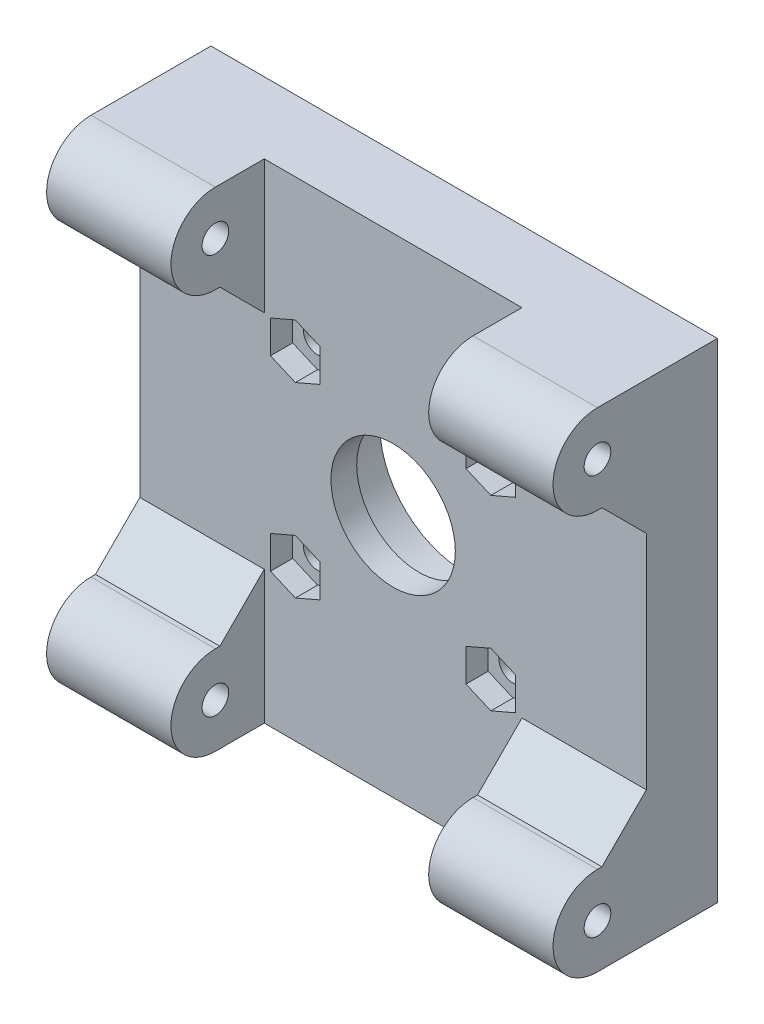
ISO-10303-21;
HEADER;
FILE_DESCRIPTION(('STEP AP214'),'2;1');
FILE_NAME('part.step','',(''),(''),'','','');
FILE_SCHEMA(('AUTOMOTIVE_DESIGN { 1 0 10303 214 1 1 1 1 }'));
ENDSEC;
DATA;
#1=APPLICATION_CONTEXT('core data for automotive mechanical design processes');
#2=APPLICATION_PROTOCOL_DEFINITION('international standard','automotive_design',2000,#1);
#3=PRODUCT_CONTEXT('',#1,'mechanical');
#4=PRODUCT('Part','Part','',(#3));
#5=PRODUCT_RELATED_PRODUCT_CATEGORY('part','',(#4));
#6=PRODUCT_DEFINITION_FORMATION('','',#4);
#7=PRODUCT_DEFINITION_CONTEXT('part definition',#1,'design');
#8=PRODUCT_DEFINITION('design','',#6,#7);
#9=PRODUCT_DEFINITION_SHAPE('','',#8);
#10=(LENGTH_UNIT() NAMED_UNIT(*) SI_UNIT(.MILLI.,.METRE.));
#11=(NAMED_UNIT(*) PLANE_ANGLE_UNIT() SI_UNIT($,.RADIAN.));
#12=(NAMED_UNIT(*) SI_UNIT($,.STERADIAN.) SOLID_ANGLE_UNIT());
#13=UNCERTAINTY_MEASURE_WITH_UNIT(LENGTH_MEASURE(1.E-05),#10,'distance_accuracy_value','');
#14=(GEOMETRIC_REPRESENTATION_CONTEXT(3) GLOBAL_UNCERTAINTY_ASSIGNED_CONTEXT((#13)) GLOBAL_UNIT_ASSIGNED_CONTEXT((#10,
#11,#12)) REPRESENTATION_CONTEXT('',''));
#15=CARTESIAN_POINT('',(0.,0.,0.));
#16=DIRECTION('',(0.,0.,1.));
#17=DIRECTION('',(1.,0.,0.));
#18=AXIS2_PLACEMENT_3D('',#15,#16,#17);
#19=CARTESIAN_POINT('',(13.0755319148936,-1.45957446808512,18.5));
#20=DIRECTION('',(0.,0.,-1.));
#21=DIRECTION('',(-1.,0.,0.));
#22=AXIS2_PLACEMENT_3D('',#19,#20,#21);
#23=CYLINDRICAL_SURFACE('',#22,1.6);
#24=CARTESIAN_POINT('',(13.0755319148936,-1.45957446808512,0.));
#25=DIRECTION('',(0.,0.,-1.));
#26=DIRECTION('',(-1.,0.,0.));
#27=AXIS2_PLACEMENT_3D('',#24,#25,#26);
#28=CIRCLE('',#27,1.6);
#29=CARTESIAN_POINT('',(11.4755319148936,-1.45957446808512,0.));
#30=VERTEX_POINT('',#29);
#31=EDGE_CURVE('E551',#30,#30,#28,.T.);
#32=ORIENTED_EDGE('',*,*,#31,.T.);
#33=EDGE_LOOP('',(#32));
#34=FACE_BOUND('',#33,.T.);
#35=CARTESIAN_POINT('',(13.0755319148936,-1.45957446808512,5.5));
#36=DIRECTION('',(0.,0.,1.));
#37=DIRECTION('',(1.,0.,0.));
#38=AXIS2_PLACEMENT_3D('',#35,#36,#37);
#39=CIRCLE('',#38,1.6);
#40=CARTESIAN_POINT('',(14.6755319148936,-1.45957446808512,5.5));
#41=VERTEX_POINT('',#40);
#42=EDGE_CURVE('E346',#41,#41,#39,.F.);
#43=ORIENTED_EDGE('',*,*,#42,.F.);
#44=EDGE_LOOP('',(#43));
#45=FACE_BOUND('',#44,.T.);
#46=ADVANCED_FACE('F41',(#34,#45),#23,.F.);
#47=CARTESIAN_POINT('',(-8.92446808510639,-1.45957446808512,18.5));
#48=DIRECTION('',(0.,0.,-1.));
#49=DIRECTION('',(-1.,0.,0.));
#50=AXIS2_PLACEMENT_3D('',#47,#48,#49);
#51=CYLINDRICAL_SURFACE('',#50,1.6);
#52=CARTESIAN_POINT('',(-8.92446808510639,-1.45957446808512,0.));
#53=DIRECTION('',(0.,0.,-1.));
#54=DIRECTION('',(-1.,0.,0.));
#55=AXIS2_PLACEMENT_3D('',#52,#53,#54);
#56=CIRCLE('',#55,1.6);
#57=CARTESIAN_POINT('',(-10.5244680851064,-1.45957446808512,0.));
#58=VERTEX_POINT('',#57);
#59=EDGE_CURVE('E555',#58,#58,#56,.F.);
#60=ORIENTED_EDGE('',*,*,#59,.F.);
#61=EDGE_LOOP('',(#60));
#62=FACE_BOUND('',#61,.T.);
#63=CARTESIAN_POINT('',(-8.92446808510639,-1.45957446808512,5.5));
#64=DIRECTION('',(0.,0.,1.));
#65=DIRECTION('',(1.,0.,0.));
#66=AXIS2_PLACEMENT_3D('',#63,#64,#65);
#67=CIRCLE('',#66,1.6);
#68=CARTESIAN_POINT('',(-7.32446808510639,-1.45957446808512,5.5));
#69=VERTEX_POINT('',#68);
#70=EDGE_CURVE('E490',#69,#69,#67,.F.);
#71=ORIENTED_EDGE('',*,*,#70,.F.);
#72=EDGE_LOOP('',(#71));
#73=FACE_BOUND('',#72,.T.);
#74=ADVANCED_FACE('F813',(#62,#73),#51,.F.);
#75=CARTESIAN_POINT('',(-8.9244680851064,-22.4595744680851,18.5));
#76=DIRECTION('',(0.,0.,-1.));
#77=DIRECTION('',(-1.,0.,0.));
#78=AXIS2_PLACEMENT_3D('',#75,#76,#77);
#79=CYLINDRICAL_SURFACE('',#78,1.6);
#80=CARTESIAN_POINT('',(-8.9244680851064,-22.4595744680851,0.));
#81=DIRECTION('',(0.,0.,-1.));
#82=DIRECTION('',(-1.,0.,0.));
#83=AXIS2_PLACEMENT_3D('',#80,#81,#82);
#84=CIRCLE('',#83,1.6);
#85=CARTESIAN_POINT('',(-10.5244680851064,-22.4595744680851,0.));
#86=VERTEX_POINT('',#85);
#87=EDGE_CURVE('E558',#86,#86,#84,.F.);
#88=ORIENTED_EDGE('',*,*,#87,.F.);
#89=EDGE_LOOP('',(#88));
#90=FACE_BOUND('',#89,.T.);
#91=CARTESIAN_POINT('',(-8.9244680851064,-22.4595744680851,5.5));
#92=DIRECTION('',(0.,0.,1.));
#93=DIRECTION('',(1.,0.,0.));
#94=AXIS2_PLACEMENT_3D('',#91,#92,#93);
#95=CIRCLE('',#94,1.6);
#96=CARTESIAN_POINT('',(-7.3244680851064,-22.4595744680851,5.5));
#97=VERTEX_POINT('',#96);
#98=EDGE_CURVE('E439',#97,#97,#95,.F.);
#99=ORIENTED_EDGE('',*,*,#98,.F.);
#100=EDGE_LOOP('',(#99));
#101=FACE_BOUND('',#100,.T.);
#102=ADVANCED_FACE('F819',(#90,#101),#79,.F.);
#103=CARTESIAN_POINT('',(13.0755319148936,-22.4595744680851,18.5));
#104=DIRECTION('',(0.,0.,-1.));
#105=DIRECTION('',(-1.,0.,0.));
#106=AXIS2_PLACEMENT_3D('',#103,#104,#105);
#107=CYLINDRICAL_SURFACE('',#106,1.6);
#108=CARTESIAN_POINT('',(13.0755319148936,-22.4595744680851,0.));
#109=DIRECTION('',(0.,0.,-1.));
#110=DIRECTION('',(-1.,0.,0.));
#111=AXIS2_PLACEMENT_3D('',#108,#109,#110);
#112=CIRCLE('',#111,1.6);
#113=CARTESIAN_POINT('',(11.4755319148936,-22.4595744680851,0.));
#114=VERTEX_POINT('',#113);
#115=EDGE_CURVE('E548',#114,#114,#112,.T.);
#116=ORIENTED_EDGE('',*,*,#115,.T.);
#117=EDGE_LOOP('',(#116));
#118=FACE_BOUND('',#117,.T.);
#119=CARTESIAN_POINT('',(13.0755319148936,-22.4595744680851,5.5));
#120=DIRECTION('',(0.,0.,1.));
#121=DIRECTION('',(1.,0.,0.));
#122=AXIS2_PLACEMENT_3D('',#119,#120,#121);
#123=CIRCLE('',#122,1.6);
#124=CARTESIAN_POINT('',(14.6755319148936,-22.4595744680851,5.5));
#125=VERTEX_POINT('',#124);
#126=EDGE_CURVE('E387',#125,#125,#123,.F.);
#127=ORIENTED_EDGE('',*,*,#126,.F.);
#128=EDGE_LOOP('',(#127));
#129=FACE_BOUND('',#128,.T.);
#130=ADVANCED_FACE('F829',(#118,#129),#107,.F.);
#131=CARTESIAN_POINT('',(2.07553191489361,-11.9595744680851,18.5));
#132=DIRECTION('',(0.,0.,-1.));
#133=DIRECTION('',(-1.,0.,0.));
#134=AXIS2_PLACEMENT_3D('',#131,#132,#133);
#135=CYLINDRICAL_SURFACE('',#134,7.);
#136=CARTESIAN_POINT('',(2.07553191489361,-11.9595744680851,8.));
#137=DIRECTION('',(0.,0.,1.));
#138=DIRECTION('',(1.,0.,0.));
#139=AXIS2_PLACEMENT_3D('',#136,#137,#138);
#140=CIRCLE('',#139,7.);
#141=CARTESIAN_POINT('',(9.07553191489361,-11.9595744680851,8.));
#142=VERTEX_POINT('',#141);
#143=EDGE_CURVE('E554',#142,#142,#140,.T.);
#144=ORIENTED_EDGE('',*,*,#143,.T.);
#145=EDGE_LOOP('',(#144));
#146=FACE_BOUND('',#145,.T.);
#147=CARTESIAN_POINT('',(2.07553191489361,-11.9595744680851,5.1));
#148=DIRECTION('',(0.,0.,-1.));
#149=DIRECTION('',(-1.,0.,0.));
#150=AXIS2_PLACEMENT_3D('',#147,#148,#149);
#151=CIRCLE('',#150,7.);
#152=CARTESIAN_POINT('',(-4.92446808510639,-11.9595744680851,5.1));
#153=VERTEX_POINT('',#152);
#154=EDGE_CURVE('E542',#153,#153,#151,.T.);
#155=ORIENTED_EDGE('',*,*,#154,.T.);
#156=EDGE_LOOP('',(#155));
#157=FACE_BOUND('',#156,.T.);
#158=ADVANCED_FACE('F833',(#146,#157),#135,.F.);
#159=CARTESIAN_POINT('',(0.,0.,8.));
#160=DIRECTION('',(0.,0.,1.));
#161=DIRECTION('',(1.,0.,0.));
#162=AXIS2_PLACEMENT_3D('',#159,#160,#161);
#163=PLANE('',#162);
#164=DIRECTION('',(0.918009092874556,-0.396559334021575,0.));
#165=VECTOR('',#164,1.);
#166=CARTESIAN_POINT('',(-10.6901192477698,-24.7469314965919,8.));
#167=LINE('',#166,#165);
#168=CARTESIAN_POINT('',(-11.7245780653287,-24.3000684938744,8.));
#169=VERTEX_POINT('',#168);
#170=CARTESIAN_POINT('',(-8.92465033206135,-25.5095744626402,8.));
#171=VERTEX_POINT('',#170);
#172=EDGE_CURVE('E461',#169,#171,#167,.T.);
#173=ORIENTED_EDGE('',*,*,#172,.F.);
#174=DIRECTION('',(-5.97530999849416E-05,-0.999999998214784,0.));
#175=VECTOR('',#174,1.);
#176=CARTESIAN_POINT('',(-11.7231260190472,0.000700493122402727,8.));
#177=LINE('',#176,#175);
#178=CARTESIAN_POINT('',(-11.7243580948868,-20.6187458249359,8.));
#179=VERTEX_POINT('',#178);
#180=EDGE_CURVE('E443',#179,#169,#177,.T.);
#181=ORIENTED_EDGE('',*,*,#180,.F.);
#182=DIRECTION('',(0.918056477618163,0.396449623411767,0.));
#183=VECTOR('',#182,1.);
#184=CARTESIAN_POINT('',(5.66171919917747,-13.1108157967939,8.));
#185=LINE('',#184,#183);
#186=CARTESIAN_POINT('',(-8.92428583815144,-19.40957447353,8.));
#187=VERTEX_POINT('',#186);
#188=EDGE_CURVE('E472',#179,#187,#185,.T.);
#189=ORIENTED_EDGE('',*,*,#188,.T.);
#190=DIRECTION('',(0.918009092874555,-0.396559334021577,0.));
#191=VECTOR('',#190,1.);
#192=CARTESIAN_POINT('',(-8.46938697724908,-19.6060805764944,8.));
#193=LINE('',#192,#191);
#194=CARTESIAN_POINT('',(-6.12435810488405,-20.6190804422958,8.));
#195=VERTEX_POINT('',#194);
#196=EDGE_CURVE('E469',#187,#195,#193,.T.);
#197=ORIENTED_EDGE('',*,*,#196,.T.);
#198=DIRECTION('',(-5.9753099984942E-05,-0.999999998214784,0.));
#199=VECTOR('',#198,1.);
#200=CARTESIAN_POINT('',(-6.12312602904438,0.000365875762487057,8.));
#201=LINE('',#200,#199);
#202=CARTESIAN_POINT('',(-6.12457807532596,-24.3004031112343,8.));
#203=VERTEX_POINT('',#202);
#204=EDGE_CURVE('E466',#195,#203,#201,.T.);
#205=ORIENTED_EDGE('',*,*,#204,.T.);
#206=DIRECTION('',(0.918056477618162,0.396449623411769,0.));
#207=VECTOR('',#206,1.);
#208=CARTESIAN_POINT('',(7.8818370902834,-18.2519320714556,8.));
#209=LINE('',#208,#207);
#210=EDGE_CURVE('E463',#171,#203,#209,.T.);
#211=ORIENTED_EDGE('',*,*,#210,.F.);
#212=EDGE_LOOP('',(#173,#181,#189,#197,#205,#211));
#213=FACE_BOUND('',#212,.T.);
#214=DIRECTION('',(0.918009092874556,-0.396559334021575,0.));
#215=VECTOR('',#214,1.);
#216=CARTESIAN_POINT('',(-7.23041452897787,-16.7379398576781,8.));
#217=LINE('',#216,#215);
#218=CARTESIAN_POINT('',(10.2754219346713,-24.3000684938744,8.));
#219=VERTEX_POINT('',#218);
#220=CARTESIAN_POINT('',(13.0753496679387,-25.5095744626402,8.));
#221=VERTEX_POINT('',#220);
#222=EDGE_CURVE('E409',#219,#221,#217,.T.);
#223=ORIENTED_EDGE('',*,*,#222,.F.);
#224=DIRECTION('',(-5.97530999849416E-05,-0.999999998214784,0.));
#225=VECTOR('',#224,1.);
#226=CARTESIAN_POINT('',(10.2768739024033,-0.000614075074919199,8.));
#227=LINE('',#226,#225);
#228=CARTESIAN_POINT('',(10.2756419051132,-20.6187458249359,8.));
#229=VERTEX_POINT('',#228);
#230=EDGE_CURVE('E391',#229,#219,#227,.T.);
#231=ORIENTED_EDGE('',*,*,#230,.F.);
#232=DIRECTION('',(0.918056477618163,0.396449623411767,0.));
#233=VECTOR('',#232,1.);
#234=CARTESIAN_POINT('',(9.11950988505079,-21.1180049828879,8.));
#235=LINE('',#234,#233);
#236=CARTESIAN_POINT('',(13.0757141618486,-19.40957447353,8.));
#237=VERTEX_POINT('',#236);
#238=EDGE_CURVE('E421',#229,#237,#235,.T.);
#239=ORIENTED_EDGE('',*,*,#238,.T.);
#240=DIRECTION('',(0.918009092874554,-0.396559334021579,0.));
#241=VECTOR('',#240,1.);
#242=CARTESIAN_POINT('',(-5.00968225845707,-11.5970889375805,8.));
#243=LINE('',#242,#241);
#244=CARTESIAN_POINT('',(15.8756418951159,-20.6190804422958,8.));
#245=VERTEX_POINT('',#244);
#246=EDGE_CURVE('E418',#237,#245,#243,.T.);
#247=ORIENTED_EDGE('',*,*,#246,.T.);
#248=DIRECTION('',(-5.9753099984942E-05,-0.999999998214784,0.));
#249=VECTOR('',#248,1.);
#250=CARTESIAN_POINT('',(15.8768738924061,-0.000948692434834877,8.));
#251=LINE('',#250,#249);
#252=CARTESIAN_POINT('',(15.875421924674,-24.3004031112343,8.));
#253=VERTEX_POINT('',#252);
#254=EDGE_CURVE('E415',#245,#253,#251,.T.);
#255=ORIENTED_EDGE('',*,*,#254,.T.);
#256=DIRECTION('',(0.918056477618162,0.396449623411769,0.));
#257=VECTOR('',#256,1.);
#258=CARTESIAN_POINT('',(11.3396277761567,-26.2591212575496,8.));
#259=LINE('',#258,#257);
#260=EDGE_CURVE('E411',#221,#253,#259,.T.);
#261=ORIENTED_EDGE('',*,*,#260,.F.);
#262=EDGE_LOOP('',(#223,#231,#239,#247,#255,#261));
#263=FACE_BOUND('',#262,.T.);
#264=DIRECTION('',(0.918009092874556,-0.396559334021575,0.));
#265=VECTOR('',#264,1.);
#266=CARTESIAN_POINT('',(0.414532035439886,0.959614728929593,8.));
#267=LINE('',#266,#265);
#268=CARTESIAN_POINT('',(10.2754219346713,-3.30006849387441,8.));
#269=VERTEX_POINT('',#268);
#270=CARTESIAN_POINT('',(13.0753496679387,-4.50957446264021,8.));
#271=VERTEX_POINT('',#270);
#272=EDGE_CURVE('E329',#269,#271,#267,.T.);
#273=ORIENTED_EDGE('',*,*,#272,.F.);
#274=DIRECTION('',(-5.97530999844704E-05,-0.999999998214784,0.));
#275=VECTOR('',#274,1.);
#276=CARTESIAN_POINT('',(10.2756190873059,-0.000614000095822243,8.));
#277=LINE('',#276,#275);
#278=CARTESIAN_POINT('',(10.2756419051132,0.38125417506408,8.));
#279=VERTEX_POINT('',#278);
#280=EDGE_CURVE('E349',#279,#269,#277,.T.);
#281=ORIENTED_EDGE('',*,*,#280,.F.);
#282=DIRECTION('',(0.918056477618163,0.396449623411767,0.));
#283=VECTOR('',#282,1.);
#284=CARTESIAN_POINT('',(1.47628384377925,-3.41862336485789,8.));
#285=LINE('',#284,#283);
#286=CARTESIAN_POINT('',(13.0757141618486,1.59042552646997,8.));
#287=VERTEX_POINT('',#286);
#288=EDGE_CURVE('E370',#279,#287,#285,.T.);
#289=ORIENTED_EDGE('',*,*,#288,.T.);
#290=DIRECTION('',(0.918009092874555,-0.396559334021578,0.));
#291=VECTOR('',#290,1.);
#292=CARTESIAN_POINT('',(2.63526430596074,6.10046564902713,8.));
#293=LINE('',#292,#291);
#294=CARTESIAN_POINT('',(15.8756418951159,0.380919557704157,8.));
#295=VERTEX_POINT('',#294);
#296=EDGE_CURVE('E367',#287,#295,#293,.T.);
#297=ORIENTED_EDGE('',*,*,#296,.T.);
#298=DIRECTION('',(-5.97530999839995E-05,-0.999999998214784,0.));
#299=VECTOR('',#298,1.);
#300=CARTESIAN_POINT('',(15.8756190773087,-0.000948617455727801,8.));
#301=LINE('',#300,#299);
#302=CARTESIAN_POINT('',(15.875421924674,-3.30040311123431,8.));
#303=VERTEX_POINT('',#302);
#304=EDGE_CURVE('E364',#295,#303,#301,.T.);
#305=ORIENTED_EDGE('',*,*,#304,.T.);
#306=DIRECTION('',(0.918056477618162,0.39644962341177,0.));
#307=VECTOR('',#306,1.);
#308=CARTESIAN_POINT('',(3.69640173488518,-8.55973963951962,8.));
#309=LINE('',#308,#307);
#310=EDGE_CURVE('E361',#271,#303,#309,.T.);
#311=ORIENTED_EDGE('',*,*,#310,.F.);
#312=EDGE_LOOP('',(#273,#281,#289,#297,#305,#311));
#313=FACE_BOUND('',#312,.T.);
#314=DIRECTION('',(0.918009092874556,-0.396559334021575,0.));
#315=VECTOR('',#314,1.);
#316=CARTESIAN_POINT('',(-3.04517268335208,-7.04937690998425,8.));
#317=LINE('',#316,#315);
#318=CARTESIAN_POINT('',(-11.7245780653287,-3.30006849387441,8.));
#319=VERTEX_POINT('',#318);
#320=CARTESIAN_POINT('',(-8.92465033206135,-4.50957446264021,8.));
#321=VERTEX_POINT('',#320);
#322=EDGE_CURVE('E377',#319,#321,#317,.T.);
#323=ORIENTED_EDGE('',*,*,#322,.F.);
#324=DIRECTION('',(-5.97530999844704E-05,-0.999999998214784,0.));
#325=VECTOR('',#324,1.);
#326=CARTESIAN_POINT('',(-11.7243808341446,0.000700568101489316,8.));
#327=LINE('',#326,#325);
#328=CARTESIAN_POINT('',(-11.7243580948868,0.381254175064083,8.));
#329=VERTEX_POINT('',#328);
#330=EDGE_CURVE('E494',#329,#319,#327,.T.);
#331=ORIENTED_EDGE('',*,*,#330,.F.);
#332=DIRECTION('',(0.918056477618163,0.396449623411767,0.));
#333=VECTOR('',#332,1.);
#334=CARTESIAN_POINT('',(-1.98150684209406,4.5885658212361,8.));
#335=LINE('',#334,#333);
#336=CARTESIAN_POINT('',(-8.92428583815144,1.59042552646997,8.));
#337=VERTEX_POINT('',#336);
#338=EDGE_CURVE('E522',#329,#337,#335,.T.);
#339=ORIENTED_EDGE('',*,*,#338,.T.);
#340=DIRECTION('',(0.918009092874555,-0.396559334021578,0.));
#341=VECTOR('',#340,1.);
#342=CARTESIAN_POINT('',(-0.824440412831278,-1.90852598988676,8.));
#343=LINE('',#342,#341);
#344=CARTESIAN_POINT('',(-6.12435810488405,0.380919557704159,8.));
#345=VERTEX_POINT('',#344);
#346=EDGE_CURVE('E519',#337,#345,#343,.T.);
#347=ORIENTED_EDGE('',*,*,#346,.T.);
#348=DIRECTION('',(-5.97530999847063E-05,-0.999999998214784,0.));
#349=VECTOR('',#348,1.);
#350=CARTESIAN_POINT('',(-6.12438084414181,0.000365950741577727,8.));
#351=LINE('',#350,#349);
#352=CARTESIAN_POINT('',(-6.12457807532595,-3.30040311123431,8.));
#353=VERTEX_POINT('',#352);
#354=EDGE_CURVE('E516',#345,#353,#351,.T.);
#355=ORIENTED_EDGE('',*,*,#354,.T.);
#356=DIRECTION('',(0.918056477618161,0.39644962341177,0.));
#357=VECTOR('',#356,1.);
#358=CARTESIAN_POINT('',(0.238611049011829,-0.552550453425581,8.));
#359=LINE('',#358,#357);
#360=EDGE_CURVE('E513',#321,#353,#359,.T.);
#361=ORIENTED_EDGE('',*,*,#360,.F.);
#362=EDGE_LOOP('',(#323,#331,#339,#347,#355,#361));
#363=FACE_BOUND('',#362,.T.);
#364=ORIENTED_EDGE('',*,*,#143,.F.);
#365=EDGE_LOOP('',(#364));
#366=FACE_BOUND('',#365,.T.);
#367=DIRECTION('',(0.,-1.,0.));
#368=VECTOR('',#367,1.);
#369=CARTESIAN_POINT('',(-26.4244680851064,15.5404255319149,8.));
#370=LINE('',#369,#368);
#371=CARTESIAN_POINT('',(-26.4244680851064,0.540425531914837,8.));
#372=VERTEX_POINT('',#371);
#373=CARTESIAN_POINT('',(-26.4244680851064,-24.4595744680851,8.));
#374=VERTEX_POINT('',#373);
#375=EDGE_CURVE('E673',#372,#374,#370,.T.);
#376=ORIENTED_EDGE('',*,*,#375,.T.);
#377=DIRECTION('',(1.,0.,0.));
#378=VECTOR('',#377,1.);
#379=CARTESIAN_POINT('',(0.,-24.4595744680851,8.));
#380=LINE('',#379,#378);
#381=CARTESIAN_POINT('',(-12.4244680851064,-24.4595744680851,8.));
#382=VERTEX_POINT('',#381);
#383=EDGE_CURVE('E715',#374,#382,#380,.T.);
#384=ORIENTED_EDGE('',*,*,#383,.T.);
#385=DIRECTION('',(0.,1.,0.));
#386=VECTOR('',#385,1.);
#387=CARTESIAN_POINT('',(-12.4244680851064,0.,8.));
#388=LINE('',#387,#386);
#389=CARTESIAN_POINT('',(-12.4244680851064,-39.4595744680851,8.));
#390=VERTEX_POINT('',#389);
#391=EDGE_CURVE('E628',#390,#382,#388,.T.);
#392=ORIENTED_EDGE('',*,*,#391,.F.);
#393=DIRECTION('',(1.,0.,0.));
#394=VECTOR('',#393,1.);
#395=CARTESIAN_POINT('',(-26.4244680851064,-39.4595744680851,8.));
#396=LINE('',#395,#394);
#397=CARTESIAN_POINT('',(16.5755319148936,-39.4595744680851,8.));
#398=VERTEX_POINT('',#397);
#399=EDGE_CURVE('E676',#390,#398,#396,.T.);
#400=ORIENTED_EDGE('',*,*,#399,.T.);
#401=DIRECTION('',(0.,1.,0.));
#402=VECTOR('',#401,1.);
#403=CARTESIAN_POINT('',(16.5755319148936,0.,8.));
#404=LINE('',#403,#402);
#405=CARTESIAN_POINT('',(16.5755319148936,-24.4595744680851,8.));
#406=VERTEX_POINT('',#405);
#407=EDGE_CURVE('E575',#398,#406,#404,.T.);
#408=ORIENTED_EDGE('',*,*,#407,.T.);
#409=DIRECTION('',(1.,0.,0.));
#410=VECTOR('',#409,1.);
#411=CARTESIAN_POINT('',(30.5755319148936,-24.4595744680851,8.));
#412=LINE('',#411,#410);
#413=CARTESIAN_POINT('',(30.5755319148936,-24.4595744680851,8.));
#414=VERTEX_POINT('',#413);
#415=EDGE_CURVE('E712',#406,#414,#412,.T.);
#416=ORIENTED_EDGE('',*,*,#415,.T.);
#417=DIRECTION('',(0.,1.,0.));
#418=VECTOR('',#417,1.);
#419=CARTESIAN_POINT('',(30.5755319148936,15.5404255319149,8.));
#420=LINE('',#419,#418);
#421=CARTESIAN_POINT('',(30.5755319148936,0.540425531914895,8.));
#422=VERTEX_POINT('',#421);
#423=EDGE_CURVE('E679',#414,#422,#420,.T.);
#424=ORIENTED_EDGE('',*,*,#423,.T.);
#425=DIRECTION('',(-1.,0.,0.));
#426=VECTOR('',#425,1.);
#427=CARTESIAN_POINT('',(0.,0.54042553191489,8.));
#428=LINE('',#427,#426);
#429=CARTESIAN_POINT('',(16.5755319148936,0.540425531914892,8.));
#430=VERTEX_POINT('',#429);
#431=EDGE_CURVE('E709',#422,#430,#428,.T.);
#432=ORIENTED_EDGE('',*,*,#431,.T.);
#433=DIRECTION('',(0.,1.,0.));
#434=VECTOR('',#433,1.);
#435=CARTESIAN_POINT('',(16.5755319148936,0.,8.));
#436=LINE('',#435,#434);
#437=CARTESIAN_POINT('',(16.5755319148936,15.5404255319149,8.));
#438=VERTEX_POINT('',#437);
#439=EDGE_CURVE('E594',#430,#438,#436,.T.);
#440=ORIENTED_EDGE('',*,*,#439,.T.);
#441=DIRECTION('',(-1.,0.,0.));
#442=VECTOR('',#441,1.);
#443=CARTESIAN_POINT('',(-26.4244680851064,15.5404255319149,8.));
#444=LINE('',#443,#442);
#445=CARTESIAN_POINT('',(-12.4244680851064,15.5404255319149,8.));
#446=VERTEX_POINT('',#445);
#447=EDGE_CURVE('E682',#438,#446,#444,.T.);
#448=ORIENTED_EDGE('',*,*,#447,.T.);
#449=DIRECTION('',(0.,1.,0.));
#450=VECTOR('',#449,1.);
#451=CARTESIAN_POINT('',(-12.4244680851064,0.,8.));
#452=LINE('',#451,#450);
#453=CARTESIAN_POINT('',(-12.4244680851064,0.54042553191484,8.));
#454=VERTEX_POINT('',#453);
#455=EDGE_CURVE('E654',#454,#446,#452,.T.);
#456=ORIENTED_EDGE('',*,*,#455,.F.);
#457=DIRECTION('',(-1.,0.,0.));
#458=VECTOR('',#457,1.);
#459=CARTESIAN_POINT('',(-26.4244680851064,0.540425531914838,8.));
#460=LINE('',#459,#458);
#461=EDGE_CURVE('E706',#454,#372,#460,.T.);
#462=ORIENTED_EDGE('',*,*,#461,.T.);
#463=EDGE_LOOP('',(#376,#384,#392,#400,#408,#416,#424,#432,#440,#448,#456,#462));
#464=FACE_BOUND('',#463,.T.);
#465=ADVANCED_FACE('F757',(#213,#263,#313,#363,#366,#464),#163,.T.);
#466=CARTESIAN_POINT('',(0.,0.,0.));
#467=DIRECTION('',(0.,0.,1.));
#468=DIRECTION('',(1.,0.,0.));
#469=AXIS2_PLACEMENT_3D('',#466,#467,#468);
#470=PLANE('',#469);
#471=CARTESIAN_POINT('',(2.07553191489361,-11.9595744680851,0.));
#472=DIRECTION('',(0.,0.,-1.));
#473=DIRECTION('',(-1.,0.,0.));
#474=AXIS2_PLACEMENT_3D('',#471,#472,#473);
#475=CIRCLE('',#474,9.5);
#476=CARTESIAN_POINT('',(-7.42446808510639,-11.9595744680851,0.));
#477=VERTEX_POINT('',#476);
#478=EDGE_CURVE('E529',#477,#477,#475,.T.);
#479=ORIENTED_EDGE('',*,*,#478,.F.);
#480=EDGE_LOOP('',(#479));
#481=FACE_BOUND('',#480,.T.);
#482=ORIENTED_EDGE('',*,*,#115,.F.);
#483=EDGE_LOOP('',(#482));
#484=FACE_BOUND('',#483,.T.);
#485=ORIENTED_EDGE('',*,*,#31,.F.);
#486=EDGE_LOOP('',(#485));
#487=FACE_BOUND('',#486,.T.);
#488=DIRECTION('',(0.,-1.,0.));
#489=VECTOR('',#488,1.);
#490=CARTESIAN_POINT('',(-26.4244680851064,15.5404255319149,0.));
#491=LINE('',#490,#489);
#492=CARTESIAN_POINT('',(-26.4244680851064,15.5404255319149,0.));
#493=VERTEX_POINT('',#492);
#494=CARTESIAN_POINT('',(-26.4244680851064,-39.4595744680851,0.));
#495=VERTEX_POINT('',#494);
#496=EDGE_CURVE('E670',#493,#495,#491,.T.);
#497=ORIENTED_EDGE('',*,*,#496,.F.);
#498=DIRECTION('',(-1.,0.,0.));
#499=VECTOR('',#498,1.);
#500=CARTESIAN_POINT('',(-26.4244680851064,15.5404255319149,0.));
#501=LINE('',#500,#499);
#502=CARTESIAN_POINT('',(30.5755319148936,15.5404255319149,0.));
#503=VERTEX_POINT('',#502);
#504=EDGE_CURVE('E677',#503,#493,#501,.T.);
#505=ORIENTED_EDGE('',*,*,#504,.F.);
#506=DIRECTION('',(0.,1.,0.));
#507=VECTOR('',#506,1.);
#508=CARTESIAN_POINT('',(30.5755319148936,15.5404255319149,0.));
#509=LINE('',#508,#507);
#510=CARTESIAN_POINT('',(30.5755319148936,-39.4595744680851,0.));
#511=VERTEX_POINT('',#510);
#512=EDGE_CURVE('E689',#511,#503,#509,.T.);
#513=ORIENTED_EDGE('',*,*,#512,.F.);
#514=DIRECTION('',(1.,0.,0.));
#515=VECTOR('',#514,1.);
#516=CARTESIAN_POINT('',(-26.4244680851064,-39.4595744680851,0.));
#517=LINE('',#516,#515);
#518=EDGE_CURVE('E687',#495,#511,#517,.T.);
#519=ORIENTED_EDGE('',*,*,#518,.F.);
#520=EDGE_LOOP('',(#497,#505,#513,#519));
#521=FACE_BOUND('',#520,.T.);
#522=ORIENTED_EDGE('',*,*,#59,.T.);
#523=EDGE_LOOP('',(#522));
#524=FACE_BOUND('',#523,.T.);
#525=ORIENTED_EDGE('',*,*,#87,.T.);
#526=EDGE_LOOP('',(#525));
#527=FACE_BOUND('',#526,.T.);
#528=ADVANCED_FACE('F779',(#481,#484,#487,#521,#524,#527),#470,.F.);
#529=CARTESIAN_POINT('',(-26.4244680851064,15.5404255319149,8.));
#530=DIRECTION('',(1.,0.,0.));
#531=DIRECTION('',(0.,1.,0.));
#532=AXIS2_PLACEMENT_3D('',#529,#530,#531);
#533=PLANE('',#532);
#534=ORIENTED_EDGE('',*,*,#496,.T.);
#535=DIRECTION('',(0.,0.,-1.));
#536=VECTOR('',#535,1.);
#537=CARTESIAN_POINT('',(-26.4244680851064,-39.4595744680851,8.));
#538=LINE('',#537,#536);
#539=CARTESIAN_POINT('',(-26.4244680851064,-39.4595744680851,13.5));
#540=VERTEX_POINT('',#539);
#541=EDGE_CURVE('E700',#540,#495,#538,.T.);
#542=ORIENTED_EDGE('',*,*,#541,.F.);
#543=CARTESIAN_POINT('',(-26.4244680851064,-34.4595744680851,13.5));
#544=DIRECTION('',(-1.,0.,0.));
#545=DIRECTION('',(0.,-1.,0.));
#546=AXIS2_PLACEMENT_3D('',#543,#544,#545);
#547=CIRCLE('',#546,5.00000000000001);
#548=CARTESIAN_POINT('',(-26.4244680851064,-29.4595744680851,13.5));
#549=VERTEX_POINT('',#548);
#550=EDGE_CURVE('E636',#540,#549,#547,.T.);
#551=ORIENTED_EDGE('',*,*,#550,.T.);
#552=DIRECTION('',(0.,0.,1.));
#553=VECTOR('',#552,1.);
#554=CARTESIAN_POINT('',(-26.4244680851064,-29.4595744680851,0.));
#555=LINE('',#554,#553);
#556=CARTESIAN_POINT('',(-26.4244680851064,-29.4595744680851,13.));
#557=VERTEX_POINT('',#556);
#558=EDGE_CURVE('E623',#557,#549,#555,.T.);
#559=ORIENTED_EDGE('',*,*,#558,.F.);
#560=DIRECTION('',(0.,0.707106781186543,-0.707106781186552));
#561=VECTOR('',#560,1.);
#562=CARTESIAN_POINT('',(-26.4244680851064,-4.45957446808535,-12.));
#563=LINE('',#562,#561);
#564=EDGE_CURVE('E724',#557,#374,#563,.T.);
#565=ORIENTED_EDGE('',*,*,#564,.T.);
#566=ORIENTED_EDGE('',*,*,#375,.F.);
#567=DIRECTION('',(0.,-0.707106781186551,-0.707106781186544));
#568=VECTOR('',#567,1.);
#569=CARTESIAN_POINT('',(-26.4244680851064,8.04042553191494,15.5));
#570=LINE('',#569,#568);
#571=CARTESIAN_POINT('',(-26.4244680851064,5.54042553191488,13.));
#572=VERTEX_POINT('',#571);
#573=EDGE_CURVE('E50',#372,#572,#570,.F.);
#574=ORIENTED_EDGE('',*,*,#573,.T.);
#575=DIRECTION('',(0.,0.,1.));
#576=VECTOR('',#575,1.);
#577=CARTESIAN_POINT('',(-26.4244680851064,5.54042553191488,0.));
#578=LINE('',#577,#576);
#579=CARTESIAN_POINT('',(-26.4244680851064,5.54042553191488,13.5));
#580=VERTEX_POINT('',#579);
#581=EDGE_CURVE('E643',#572,#580,#578,.T.);
#582=ORIENTED_EDGE('',*,*,#581,.T.);
#583=CARTESIAN_POINT('',(-26.4244680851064,10.5404255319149,13.5));
#584=DIRECTION('',(-1.,0.,0.));
#585=DIRECTION('',(0.,-1.,0.));
#586=AXIS2_PLACEMENT_3D('',#583,#584,#585);
#587=CIRCLE('',#586,5.);
#588=CARTESIAN_POINT('',(-26.4244680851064,15.5404255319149,13.5));
#589=VERTEX_POINT('',#588);
#590=EDGE_CURVE('E662',#580,#589,#587,.T.);
#591=ORIENTED_EDGE('',*,*,#590,.T.);
#592=DIRECTION('',(0.,0.,-1.));
#593=VECTOR('',#592,1.);
#594=CARTESIAN_POINT('',(-26.4244680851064,15.5404255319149,8.));
#595=LINE('',#594,#593);
#596=EDGE_CURVE('E684',#589,#493,#595,.T.);
#597=ORIENTED_EDGE('',*,*,#596,.T.);
#598=EDGE_LOOP('',(#534,#542,#551,#559,#565,#566,#574,#582,#591,#597));
#599=FACE_BOUND('',#598,.T.);
#600=CARTESIAN_POINT('',(-26.4244680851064,10.5404255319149,13.5));
#601=DIRECTION('',(-1.,0.,0.));
#602=DIRECTION('',(0.,-1.,0.));
#603=AXIS2_PLACEMENT_3D('',#600,#601,#602);
#604=CIRCLE('',#603,1.5);
#605=CARTESIAN_POINT('',(-26.4244680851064,9.04042553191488,13.5));
#606=VERTEX_POINT('',#605);
#607=EDGE_CURVE('E649',#606,#606,#604,.T.);
#608=ORIENTED_EDGE('',*,*,#607,.F.);
#609=EDGE_LOOP('',(#608));
#610=FACE_BOUND('',#609,.T.);
#611=CARTESIAN_POINT('',(-26.4244680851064,-34.4595744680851,13.5));
#612=DIRECTION('',(-1.,0.,0.));
#613=DIRECTION('',(0.,-1.,0.));
#614=AXIS2_PLACEMENT_3D('',#611,#612,#613);
#615=CIRCLE('',#614,1.5);
#616=CARTESIAN_POINT('',(-26.4244680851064,-35.9595744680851,13.5));
#617=VERTEX_POINT('',#616);
#618=EDGE_CURVE('E616',#617,#617,#615,.T.);
#619=ORIENTED_EDGE('',*,*,#618,.F.);
#620=EDGE_LOOP('',(#619));
#621=FACE_BOUND('',#620,.T.);
#622=ADVANCED_FACE('F784',(#599,#610,#621),#533,.F.);
#623=CARTESIAN_POINT('',(-26.4244680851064,-39.4595744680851,8.));
#624=DIRECTION('',(0.,1.,0.));
#625=DIRECTION('',(0.,0.,1.));
#626=AXIS2_PLACEMENT_3D('',#623,#624,#625);
#627=PLANE('',#626);
#628=ORIENTED_EDGE('',*,*,#518,.T.);
#629=DIRECTION('',(0.,0.,-1.));
#630=VECTOR('',#629,1.);
#631=CARTESIAN_POINT('',(30.5755319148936,-39.4595744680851,8.));
#632=LINE('',#631,#630);
#633=CARTESIAN_POINT('',(30.5755319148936,-39.4595744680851,13.5));
#634=VERTEX_POINT('',#633);
#635=EDGE_CURVE('E697',#634,#511,#632,.T.);
#636=ORIENTED_EDGE('',*,*,#635,.F.);
#637=DIRECTION('',(1.,0.,0.));
#638=VECTOR('',#637,1.);
#639=CARTESIAN_POINT('',(16.5755319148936,-39.4595744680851,13.5));
#640=LINE('',#639,#638);
#641=CARTESIAN_POINT('',(16.5755319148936,-39.4595744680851,13.5));
#642=VERTEX_POINT('',#641);
#643=EDGE_CURVE('E579',#642,#634,#640,.T.);
#644=ORIENTED_EDGE('',*,*,#643,.F.);
#645=DIRECTION('',(0.,0.,1.));
#646=VECTOR('',#645,1.);
#647=CARTESIAN_POINT('',(16.5755319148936,-39.4595744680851,0.));
#648=LINE('',#647,#646);
#649=EDGE_CURVE('E573',#398,#642,#648,.T.);
#650=ORIENTED_EDGE('',*,*,#649,.F.);
#651=ORIENTED_EDGE('',*,*,#399,.F.);
#652=DIRECTION('',(0.,0.,1.));
#653=VECTOR('',#652,1.);
#654=CARTESIAN_POINT('',(-12.4244680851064,-39.4595744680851,0.));
#655=LINE('',#654,#653);
#656=CARTESIAN_POINT('',(-12.4244680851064,-39.4595744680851,13.5));
#657=VERTEX_POINT('',#656);
#658=EDGE_CURVE('E630',#390,#657,#655,.T.);
#659=ORIENTED_EDGE('',*,*,#658,.T.);
#660=DIRECTION('',(-1.,0.,0.));
#661=VECTOR('',#660,1.);
#662=CARTESIAN_POINT('',(-12.4244680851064,-39.4595744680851,13.5));
#663=LINE('',#662,#661);
#664=EDGE_CURVE('E640',#657,#540,#663,.T.);
#665=ORIENTED_EDGE('',*,*,#664,.T.);
#666=ORIENTED_EDGE('',*,*,#541,.T.);
#667=EDGE_LOOP('',(#628,#636,#644,#650,#651,#659,#665,#666));
#668=FACE_BOUND('',#667,.T.);
#669=ADVANCED_FACE('F913',(#668),#627,.F.);
#670=CARTESIAN_POINT('',(30.5755319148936,15.5404255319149,8.));
#671=DIRECTION('',(-1.,0.,0.));
#672=DIRECTION('',(0.,-1.,0.));
#673=AXIS2_PLACEMENT_3D('',#670,#671,#672);
#674=PLANE('',#673);
#675=ORIENTED_EDGE('',*,*,#512,.T.);
#676=DIRECTION('',(0.,0.,-1.));
#677=VECTOR('',#676,1.);
#678=CARTESIAN_POINT('',(30.5755319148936,15.5404255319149,8.));
#679=LINE('',#678,#677);
#680=CARTESIAN_POINT('',(30.5755319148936,15.5404255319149,13.5));
#681=VERTEX_POINT('',#680);
#682=EDGE_CURVE('E694',#681,#503,#679,.T.);
#683=ORIENTED_EDGE('',*,*,#682,.F.);
#684=CARTESIAN_POINT('',(30.5755319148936,10.5404255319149,13.5));
#685=DIRECTION('',(-1.,0.,0.));
#686=DIRECTION('',(0.,-1.,0.));
#687=AXIS2_PLACEMENT_3D('',#684,#685,#686);
#688=CIRCLE('',#687,5.);
#689=CARTESIAN_POINT('',(30.5755319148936,5.54042553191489,13.5));
#690=VERTEX_POINT('',#689);
#691=EDGE_CURVE('E608',#690,#681,#688,.T.);
#692=ORIENTED_EDGE('',*,*,#691,.F.);
#693=DIRECTION('',(0.,0.,1.));
#694=VECTOR('',#693,1.);
#695=CARTESIAN_POINT('',(30.5755319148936,5.54042553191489,0.));
#696=LINE('',#695,#694);
#697=CARTESIAN_POINT('',(30.5755319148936,5.54042553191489,13.));
#698=VERTEX_POINT('',#697);
#699=EDGE_CURVE('E589',#698,#690,#696,.T.);
#700=ORIENTED_EDGE('',*,*,#699,.F.);
#701=DIRECTION('',(0.,-0.707106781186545,-0.70710678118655));
#702=VECTOR('',#701,1.);
#703=CARTESIAN_POINT('',(30.5755319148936,8.04042553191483,15.5));
#704=LINE('',#703,#702);
#705=EDGE_CURVE('E733',#698,#422,#704,.T.);
#706=ORIENTED_EDGE('',*,*,#705,.T.);
#707=ORIENTED_EDGE('',*,*,#423,.F.);
#708=DIRECTION('',(0.,0.707106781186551,-0.707106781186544));
#709=VECTOR('',#708,1.);
#710=CARTESIAN_POINT('',(30.5755319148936,-4.45957446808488,-12.));
#711=LINE('',#710,#709);
#712=CARTESIAN_POINT('',(30.5755319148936,-29.4595744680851,13.));
#713=VERTEX_POINT('',#712);
#714=EDGE_CURVE('E728',#414,#713,#711,.F.);
#715=ORIENTED_EDGE('',*,*,#714,.T.);
#716=DIRECTION('',(0.,0.,1.));
#717=VECTOR('',#716,1.);
#718=CARTESIAN_POINT('',(30.5755319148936,-29.4595744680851,0.));
#719=LINE('',#718,#717);
#720=CARTESIAN_POINT('',(30.5755319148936,-29.4595744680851,13.5));
#721=VERTEX_POINT('',#720);
#722=EDGE_CURVE('E570',#713,#721,#719,.T.);
#723=ORIENTED_EDGE('',*,*,#722,.T.);
#724=CARTESIAN_POINT('',(30.5755319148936,-34.4595744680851,13.5));
#725=DIRECTION('',(-1.,0.,0.));
#726=DIRECTION('',(0.,-1.,0.));
#727=AXIS2_PLACEMENT_3D('',#724,#725,#726);
#728=CIRCLE('',#727,5.00000000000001);
#729=EDGE_CURVE('E582',#634,#721,#728,.T.);
#730=ORIENTED_EDGE('',*,*,#729,.F.);
#731=ORIENTED_EDGE('',*,*,#635,.T.);
#732=EDGE_LOOP('',(#675,#683,#692,#700,#706,#707,#715,#723,#730,#731));
#733=FACE_BOUND('',#732,.T.);
#734=CARTESIAN_POINT('',(30.5755319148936,10.5404255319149,13.5));
#735=DIRECTION('',(-1.,0.,0.));
#736=DIRECTION('',(0.,-1.,0.));
#737=AXIS2_PLACEMENT_3D('',#734,#735,#736);
#738=CIRCLE('',#737,1.5);
#739=CARTESIAN_POINT('',(30.5755319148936,9.04042553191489,13.5));
#740=VERTEX_POINT('',#739);
#741=EDGE_CURVE('E595',#740,#740,#738,.T.);
#742=ORIENTED_EDGE('',*,*,#741,.T.);
#743=EDGE_LOOP('',(#742));
#744=FACE_BOUND('',#743,.T.);
#745=CARTESIAN_POINT('',(30.5755319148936,-34.4595744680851,13.5));
#746=DIRECTION('',(-1.,0.,0.));
#747=DIRECTION('',(0.,-1.,0.));
#748=AXIS2_PLACEMENT_3D('',#745,#746,#747);
#749=CIRCLE('',#748,1.5);
#750=CARTESIAN_POINT('',(30.5755319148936,-35.9595744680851,13.5));
#751=VERTEX_POINT('',#750);
#752=EDGE_CURVE('E565',#751,#751,#749,.T.);
#753=ORIENTED_EDGE('',*,*,#752,.T.);
#754=EDGE_LOOP('',(#753));
#755=FACE_BOUND('',#754,.T.);
#756=ADVANCED_FACE('F753',(#733,#744,#755),#674,.F.);
#757=CARTESIAN_POINT('',(-26.4244680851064,15.5404255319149,8.));
#758=DIRECTION('',(0.,-1.,0.));
#759=DIRECTION('',(1.,0.,0.));
#760=AXIS2_PLACEMENT_3D('',#757,#758,#759);
#761=PLANE('',#760);
#762=ORIENTED_EDGE('',*,*,#504,.T.);
#763=ORIENTED_EDGE('',*,*,#596,.F.);
#764=DIRECTION('',(-1.,0.,0.));
#765=VECTOR('',#764,1.);
#766=CARTESIAN_POINT('',(-12.4244680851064,15.5404255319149,13.5));
#767=LINE('',#766,#765);
#768=CARTESIAN_POINT('',(-12.4244680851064,15.5404255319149,13.5));
#769=VERTEX_POINT('',#768);
#770=EDGE_CURVE('E667',#769,#589,#767,.T.);
#771=ORIENTED_EDGE('',*,*,#770,.F.);
#772=DIRECTION('',(0.,0.,1.));
#773=VECTOR('',#772,1.);
#774=CARTESIAN_POINT('',(-12.4244680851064,15.5404255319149,0.));
#775=LINE('',#774,#773);
#776=EDGE_CURVE('E652',#446,#769,#775,.T.);
#777=ORIENTED_EDGE('',*,*,#776,.F.);
#778=ORIENTED_EDGE('',*,*,#447,.F.);
#779=DIRECTION('',(0.,0.,1.));
#780=VECTOR('',#779,1.);
#781=CARTESIAN_POINT('',(16.5755319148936,15.5404255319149,0.));
#782=LINE('',#781,#780);
#783=CARTESIAN_POINT('',(16.5755319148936,15.5404255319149,13.5));
#784=VERTEX_POINT('',#783);
#785=EDGE_CURVE('E598',#438,#784,#782,.T.);
#786=ORIENTED_EDGE('',*,*,#785,.T.);
#787=DIRECTION('',(1.,0.,0.));
#788=VECTOR('',#787,1.);
#789=CARTESIAN_POINT('',(16.5755319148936,15.5404255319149,13.5));
#790=LINE('',#789,#788);
#791=EDGE_CURVE('E606',#784,#681,#790,.T.);
#792=ORIENTED_EDGE('',*,*,#791,.T.);
#793=ORIENTED_EDGE('',*,*,#682,.T.);
#794=EDGE_LOOP('',(#762,#763,#771,#777,#778,#786,#792,#793));
#795=FACE_BOUND('',#794,.T.);
#796=ADVANCED_FACE('F782',(#795),#761,.F.);
#797=CARTESIAN_POINT('',(-12.4244680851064,5.54042553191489,0.));
#798=DIRECTION('',(0.,-1.,0.));
#799=DIRECTION('',(1.,0.,0.));
#800=AXIS2_PLACEMENT_3D('',#797,#798,#799);
#801=PLANE('',#800);
#802=ORIENTED_EDGE('',*,*,#581,.F.);
#803=DIRECTION('',(1.,0.,0.));
#804=VECTOR('',#803,1.);
#805=CARTESIAN_POINT('',(-12.4244680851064,5.54042553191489,13.));
#806=LINE('',#805,#804);
#807=CARTESIAN_POINT('',(-12.4244680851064,5.54042553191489,13.));
#808=VERTEX_POINT('',#807);
#809=EDGE_CURVE('E57',#572,#808,#806,.T.);
#810=ORIENTED_EDGE('',*,*,#809,.T.);
#811=DIRECTION('',(0.,0.,1.));
#812=VECTOR('',#811,1.);
#813=CARTESIAN_POINT('',(-12.4244680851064,5.54042553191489,0.));
#814=LINE('',#813,#812);
#815=CARTESIAN_POINT('',(-12.4244680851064,5.54042553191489,13.5));
#816=VERTEX_POINT('',#815);
#817=EDGE_CURVE('E646',#808,#816,#814,.T.);
#818=ORIENTED_EDGE('',*,*,#817,.T.);
#819=DIRECTION('',(-1.,0.,0.));
#820=VECTOR('',#819,1.);
#821=CARTESIAN_POINT('',(-12.4244680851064,5.54042553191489,13.5));
#822=LINE('',#821,#820);
#823=EDGE_CURVE('E660',#816,#580,#822,.T.);
#824=ORIENTED_EDGE('',*,*,#823,.T.);
#825=EDGE_LOOP('',(#802,#810,#818,#824));
#826=FACE_BOUND('',#825,.T.);
#827=ADVANCED_FACE('F920',(#826),#801,.T.);
#828=CARTESIAN_POINT('',(-12.4244680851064,10.5404255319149,13.5));
#829=DIRECTION('',(-1.,0.,0.));
#830=DIRECTION('',(0.,-1.,0.));
#831=AXIS2_PLACEMENT_3D('',#828,#829,#830);
#832=CYLINDRICAL_SURFACE('',#831,5.);
#833=ORIENTED_EDGE('',*,*,#590,.F.);
#834=ORIENTED_EDGE('',*,*,#823,.F.);
#835=CARTESIAN_POINT('',(-12.4244680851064,10.5404255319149,13.5));
#836=DIRECTION('',(-1.,0.,0.));
#837=DIRECTION('',(0.,-1.,0.));
#838=AXIS2_PLACEMENT_3D('',#835,#836,#837);
#839=CIRCLE('',#838,5.);
#840=EDGE_CURVE('E648',#816,#769,#839,.T.);
#841=ORIENTED_EDGE('',*,*,#840,.T.);
#842=ORIENTED_EDGE('',*,*,#770,.T.);
#843=EDGE_LOOP('',(#833,#834,#841,#842));
#844=FACE_BOUND('',#843,.T.);
#845=ADVANCED_FACE('F789',(#844),#832,.T.);
#846=CARTESIAN_POINT('',(-12.4244680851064,10.5404255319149,13.5));
#847=DIRECTION('',(-1.,0.,0.));
#848=DIRECTION('',(0.,-1.,0.));
#849=AXIS2_PLACEMENT_3D('',#846,#847,#848);
#850=CYLINDRICAL_SURFACE('',#849,1.5);
#851=CARTESIAN_POINT('',(-12.4244680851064,10.5404255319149,13.5));
#852=DIRECTION('',(-1.,0.,0.));
#853=DIRECTION('',(0.,-1.,0.));
#854=AXIS2_PLACEMENT_3D('',#851,#852,#853);
#855=CIRCLE('',#854,1.5);
#856=CARTESIAN_POINT('',(-12.4244680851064,9.04042553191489,13.5));
#857=VERTEX_POINT('',#856);
#858=EDGE_CURVE('E657',#857,#857,#855,.T.);
#859=ORIENTED_EDGE('',*,*,#858,.F.);
#860=EDGE_LOOP('',(#859));
#861=FACE_BOUND('',#860,.T.);
#862=ORIENTED_EDGE('',*,*,#607,.T.);
#863=EDGE_LOOP('',(#862));
#864=FACE_BOUND('',#863,.T.);
#865=ADVANCED_FACE('F931',(#861,#864),#850,.F.);
#866=CARTESIAN_POINT('',(-12.4244680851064,0.,0.));
#867=DIRECTION('',(-1.,0.,0.));
#868=DIRECTION('',(0.,-1.,0.));
#869=AXIS2_PLACEMENT_3D('',#866,#867,#868);
#870=PLANE('',#869);
#871=ORIENTED_EDGE('',*,*,#817,.F.);
#872=DIRECTION('',(0.,0.707106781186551,0.707106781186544));
#873=VECTOR('',#872,1.);
#874=CARTESIAN_POINT('',(-12.4244680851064,-3.72978723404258,3.72978723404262));
#875=LINE('',#874,#873);
#876=EDGE_CURVE('E11',#808,#454,#875,.F.);
#877=ORIENTED_EDGE('',*,*,#876,.T.);
#878=ORIENTED_EDGE('',*,*,#455,.T.);
#879=ORIENTED_EDGE('',*,*,#776,.T.);
#880=ORIENTED_EDGE('',*,*,#840,.F.);
#881=EDGE_LOOP('',(#871,#877,#878,#879,#880));
#882=FACE_BOUND('',#881,.T.);
#883=ORIENTED_EDGE('',*,*,#858,.T.);
#884=EDGE_LOOP('',(#883));
#885=FACE_BOUND('',#884,.T.);
#886=ADVANCED_FACE('F793',(#882,#885),#870,.F.);
#887=CARTESIAN_POINT('',(-12.4244680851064,-34.4595744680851,13.5));
#888=DIRECTION('',(-1.,0.,0.));
#889=DIRECTION('',(0.,-1.,0.));
#890=AXIS2_PLACEMENT_3D('',#887,#888,#889);
#891=CYLINDRICAL_SURFACE('',#890,5.00000000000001);
#892=ORIENTED_EDGE('',*,*,#550,.F.);
#893=ORIENTED_EDGE('',*,*,#664,.F.);
#894=CARTESIAN_POINT('',(-12.4244680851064,-34.4595744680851,13.5));
#895=DIRECTION('',(-1.,0.,0.));
#896=DIRECTION('',(0.,-1.,0.));
#897=AXIS2_PLACEMENT_3D('',#894,#895,#896);
#898=CIRCLE('',#897,5.00000000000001);
#899=CARTESIAN_POINT('',(-12.4244680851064,-29.4595744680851,13.5));
#900=VERTEX_POINT('',#899);
#901=EDGE_CURVE('E622',#657,#900,#898,.T.);
#902=ORIENTED_EDGE('',*,*,#901,.T.);
#903=DIRECTION('',(-1.,0.,0.));
#904=VECTOR('',#903,1.);
#905=CARTESIAN_POINT('',(-12.4244680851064,-29.4595744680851,13.5));
#906=LINE('',#905,#904);
#907=EDGE_CURVE('E633',#900,#549,#906,.T.);
#908=ORIENTED_EDGE('',*,*,#907,.T.);
#909=EDGE_LOOP('',(#892,#893,#902,#908));
#910=FACE_BOUND('',#909,.T.);
#911=ADVANCED_FACE('F937',(#910),#891,.T.);
#912=CARTESIAN_POINT('',(-12.4244680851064,-34.4595744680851,13.5));
#913=DIRECTION('',(-1.,0.,0.));
#914=DIRECTION('',(0.,-1.,0.));
#915=AXIS2_PLACEMENT_3D('',#912,#913,#914);
#916=CYLINDRICAL_SURFACE('',#915,1.5);
#917=CARTESIAN_POINT('',(-12.4244680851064,-34.4595744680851,13.5));
#918=DIRECTION('',(-1.,0.,0.));
#919=DIRECTION('',(0.,-1.,0.));
#920=AXIS2_PLACEMENT_3D('',#917,#918,#919);
#921=CIRCLE('',#920,1.5);
#922=CARTESIAN_POINT('',(-12.4244680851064,-35.9595744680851,13.5));
#923=VERTEX_POINT('',#922);
#924=EDGE_CURVE('E619',#923,#923,#921,.T.);
#925=ORIENTED_EDGE('',*,*,#924,.F.);
#926=EDGE_LOOP('',(#925));
#927=FACE_BOUND('',#926,.T.);
#928=ORIENTED_EDGE('',*,*,#618,.T.);
#929=EDGE_LOOP('',(#928));
#930=FACE_BOUND('',#929,.T.);
#931=ADVANCED_FACE('F938',(#927,#930),#916,.F.);
#932=CARTESIAN_POINT('',(-12.4244680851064,-29.4595744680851,0.));
#933=DIRECTION('',(0.,-1.,0.));
#934=DIRECTION('',(1.,0.,0.));
#935=AXIS2_PLACEMENT_3D('',#932,#933,#934);
#936=PLANE('',#935);
#937=DIRECTION('',(0.,0.,1.));
#938=VECTOR('',#937,1.);
#939=CARTESIAN_POINT('',(-12.4244680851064,-29.4595744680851,0.));
#940=LINE('',#939,#938);
#941=CARTESIAN_POINT('',(-12.4244680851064,-29.4595744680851,13.));
#942=VERTEX_POINT('',#941);
#943=EDGE_CURVE('E626',#942,#900,#940,.T.);
#944=ORIENTED_EDGE('',*,*,#943,.F.);
#945=DIRECTION('',(-1.,0.,0.));
#946=VECTOR('',#945,1.);
#947=CARTESIAN_POINT('',(-12.4244680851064,-29.4595744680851,13.));
#948=LINE('',#947,#946);
#949=EDGE_CURVE('E703',#942,#557,#948,.T.);
#950=ORIENTED_EDGE('',*,*,#949,.T.);
#951=ORIENTED_EDGE('',*,*,#558,.T.);
#952=ORIENTED_EDGE('',*,*,#907,.F.);
#953=EDGE_LOOP('',(#944,#950,#951,#952));
#954=FACE_BOUND('',#953,.T.);
#955=ADVANCED_FACE('F941',(#954),#936,.F.);
#956=CARTESIAN_POINT('',(-12.4244680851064,0.,0.));
#957=DIRECTION('',(-1.,0.,0.));
#958=DIRECTION('',(0.,-1.,0.));
#959=AXIS2_PLACEMENT_3D('',#956,#957,#958);
#960=PLANE('',#959);
#961=ORIENTED_EDGE('',*,*,#924,.T.);
#962=EDGE_LOOP('',(#961));
#963=FACE_BOUND('',#962,.T.);
#964=ORIENTED_EDGE('',*,*,#901,.F.);
#965=ORIENTED_EDGE('',*,*,#658,.F.);
#966=ORIENTED_EDGE('',*,*,#391,.T.);
#967=DIRECTION('',(0.,-0.707106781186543,0.707106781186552));
#968=VECTOR('',#967,1.);
#969=CARTESIAN_POINT('',(-12.4244680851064,-8.22978723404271,-8.22978723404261));
#970=LINE('',#969,#968);
#971=EDGE_CURVE('E726',#382,#942,#970,.T.);
#972=ORIENTED_EDGE('',*,*,#971,.T.);
#973=ORIENTED_EDGE('',*,*,#943,.T.);
#974=EDGE_LOOP('',(#964,#965,#966,#972,#973));
#975=FACE_BOUND('',#974,.T.);
#976=ADVANCED_FACE('F810',(#963,#975),#960,.F.);
#977=CARTESIAN_POINT('',(16.5755319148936,5.54042553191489,0.));
#978=DIRECTION('',(0.,1.,0.));
#979=DIRECTION('',(-1.,0.,0.));
#980=AXIS2_PLACEMENT_3D('',#977,#978,#979);
#981=PLANE('',#980);
#982=DIRECTION('',(0.,0.,1.));
#983=VECTOR('',#982,1.);
#984=CARTESIAN_POINT('',(16.5755319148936,5.54042553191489,0.));
#985=LINE('',#984,#983);
#986=CARTESIAN_POINT('',(16.5755319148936,5.54042553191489,13.));
#987=VERTEX_POINT('',#986);
#988=CARTESIAN_POINT('',(16.5755319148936,5.54042553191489,13.5));
#989=VERTEX_POINT('',#988);
#990=EDGE_CURVE('E592',#987,#989,#985,.T.);
#991=ORIENTED_EDGE('',*,*,#990,.F.);
#992=DIRECTION('',(1.,0.,0.));
#993=VECTOR('',#992,1.);
#994=CARTESIAN_POINT('',(16.5755319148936,5.54042553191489,13.));
#995=LINE('',#994,#993);
#996=EDGE_CURVE('E720',#987,#698,#995,.T.);
#997=ORIENTED_EDGE('',*,*,#996,.T.);
#998=ORIENTED_EDGE('',*,*,#699,.T.);
#999=DIRECTION('',(1.,0.,0.));
#1000=VECTOR('',#999,1.);
#1001=CARTESIAN_POINT('',(16.5755319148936,5.54042553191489,13.5));
#1002=LINE('',#1001,#1000);
#1003=EDGE_CURVE('E613',#989,#690,#1002,.T.);
#1004=ORIENTED_EDGE('',*,*,#1003,.F.);
#1005=EDGE_LOOP('',(#991,#997,#998,#1004));
#1006=FACE_BOUND('',#1005,.T.);
#1007=ADVANCED_FACE('F748',(#1006),#981,.F.);
#1008=CARTESIAN_POINT('',(16.5755319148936,10.5404255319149,13.5));
#1009=DIRECTION('',(1.,0.,0.));
#1010=DIRECTION('',(0.,1.,0.));
#1011=AXIS2_PLACEMENT_3D('',#1008,#1009,#1010);
#1012=CYLINDRICAL_SURFACE('',#1011,5.);
#1013=ORIENTED_EDGE('',*,*,#691,.T.);
#1014=ORIENTED_EDGE('',*,*,#791,.F.);
#1015=CARTESIAN_POINT('',(16.5755319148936,10.5404255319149,13.5));
#1016=DIRECTION('',(-1.,0.,0.));
#1017=DIRECTION('',(0.,-1.,0.));
#1018=AXIS2_PLACEMENT_3D('',#1015,#1016,#1017);
#1019=CIRCLE('',#1018,5.);
#1020=EDGE_CURVE('E601',#989,#784,#1019,.T.);
#1021=ORIENTED_EDGE('',*,*,#1020,.F.);
#1022=ORIENTED_EDGE('',*,*,#1003,.T.);
#1023=EDGE_LOOP('',(#1013,#1014,#1021,#1022));
#1024=FACE_BOUND('',#1023,.T.);
#1025=ADVANCED_FACE('F799',(#1024),#1012,.T.);
#1026=CARTESIAN_POINT('',(16.5755319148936,10.5404255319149,13.5));
#1027=DIRECTION('',(1.,0.,0.));
#1028=DIRECTION('',(0.,1.,0.));
#1029=AXIS2_PLACEMENT_3D('',#1026,#1027,#1028);
#1030=CYLINDRICAL_SURFACE('',#1029,1.5);
#1031=CARTESIAN_POINT('',(16.5755319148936,10.5404255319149,13.5));
#1032=DIRECTION('',(-1.,0.,0.));
#1033=DIRECTION('',(0.,-1.,0.));
#1034=AXIS2_PLACEMENT_3D('',#1031,#1032,#1033);
#1035=CIRCLE('',#1034,1.5);
#1036=CARTESIAN_POINT('',(16.5755319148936,9.04042553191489,13.5));
#1037=VERTEX_POINT('',#1036);
#1038=EDGE_CURVE('E603',#1037,#1037,#1035,.T.);
#1039=ORIENTED_EDGE('',*,*,#1038,.T.);
#1040=EDGE_LOOP('',(#1039));
#1041=FACE_BOUND('',#1040,.T.);
#1042=ORIENTED_EDGE('',*,*,#741,.F.);
#1043=EDGE_LOOP('',(#1042));
#1044=FACE_BOUND('',#1043,.T.);
#1045=ADVANCED_FACE('F801',(#1041,#1044),#1030,.F.);
#1046=CARTESIAN_POINT('',(16.5755319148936,0.,0.));
#1047=DIRECTION('',(1.,0.,0.));
#1048=DIRECTION('',(0.,-1.,0.));
#1049=AXIS2_PLACEMENT_3D('',#1046,#1047,#1048);
#1050=PLANE('',#1049);
#1051=ORIENTED_EDGE('',*,*,#439,.F.);
#1052=DIRECTION('',(0.,0.707106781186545,0.70710678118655));
#1053=VECTOR('',#1052,1.);
#1054=CARTESIAN_POINT('',(16.5755319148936,-3.72978723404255,3.72978723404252));
#1055=LINE('',#1054,#1053);
#1056=EDGE_CURVE('E735',#430,#987,#1055,.T.);
#1057=ORIENTED_EDGE('',*,*,#1056,.T.);
#1058=ORIENTED_EDGE('',*,*,#990,.T.);
#1059=ORIENTED_EDGE('',*,*,#1020,.T.);
#1060=ORIENTED_EDGE('',*,*,#785,.F.);
#1061=EDGE_LOOP('',(#1051,#1057,#1058,#1059,#1060));
#1062=FACE_BOUND('',#1061,.T.);
#1063=ORIENTED_EDGE('',*,*,#1038,.F.);
#1064=EDGE_LOOP('',(#1063));
#1065=FACE_BOUND('',#1064,.T.);
#1066=ADVANCED_FACE('F739',(#1062,#1065),#1050,.F.);
#1067=CARTESIAN_POINT('',(16.5755319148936,-34.4595744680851,13.5));
#1068=DIRECTION('',(1.,0.,0.));
#1069=DIRECTION('',(0.,1.,0.));
#1070=AXIS2_PLACEMENT_3D('',#1067,#1068,#1069);
#1071=CYLINDRICAL_SURFACE('',#1070,5.00000000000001);
#1072=ORIENTED_EDGE('',*,*,#729,.T.);
#1073=DIRECTION('',(1.,0.,0.));
#1074=VECTOR('',#1073,1.);
#1075=CARTESIAN_POINT('',(16.5755319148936,-29.4595744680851,13.5));
#1076=LINE('',#1075,#1074);
#1077=CARTESIAN_POINT('',(16.5755319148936,-29.4595744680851,13.5));
#1078=VERTEX_POINT('',#1077);
#1079=EDGE_CURVE('E586',#1078,#721,#1076,.T.);
#1080=ORIENTED_EDGE('',*,*,#1079,.F.);
#1081=CARTESIAN_POINT('',(16.5755319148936,-34.4595744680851,13.5));
#1082=DIRECTION('',(-1.,0.,0.));
#1083=DIRECTION('',(0.,-1.,0.));
#1084=AXIS2_PLACEMENT_3D('',#1081,#1082,#1083);
#1085=CIRCLE('',#1084,5.00000000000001);
#1086=EDGE_CURVE('E569',#642,#1078,#1085,.T.);
#1087=ORIENTED_EDGE('',*,*,#1086,.F.);
#1088=ORIENTED_EDGE('',*,*,#643,.T.);
#1089=EDGE_LOOP('',(#1072,#1080,#1087,#1088));
#1090=FACE_BOUND('',#1089,.T.);
#1091=ADVANCED_FACE('F772',(#1090),#1071,.T.);
#1092=CARTESIAN_POINT('',(16.5755319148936,-29.4595744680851,0.));
#1093=DIRECTION('',(0.,1.,0.));
#1094=DIRECTION('',(-1.,0.,0.));
#1095=AXIS2_PLACEMENT_3D('',#1092,#1093,#1094);
#1096=PLANE('',#1095);
#1097=ORIENTED_EDGE('',*,*,#722,.F.);
#1098=DIRECTION('',(-1.,0.,0.));
#1099=VECTOR('',#1098,1.);
#1100=CARTESIAN_POINT('',(16.5755319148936,-29.4595744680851,13.));
#1101=LINE('',#1100,#1099);
#1102=CARTESIAN_POINT('',(16.5755319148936,-29.4595744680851,13.));
#1103=VERTEX_POINT('',#1102);
#1104=EDGE_CURVE('E718',#713,#1103,#1101,.T.);
#1105=ORIENTED_EDGE('',*,*,#1104,.T.);
#1106=DIRECTION('',(0.,0.,1.));
#1107=VECTOR('',#1106,1.);
#1108=CARTESIAN_POINT('',(16.5755319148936,-29.4595744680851,0.));
#1109=LINE('',#1108,#1107);
#1110=EDGE_CURVE('E577',#1103,#1078,#1109,.T.);
#1111=ORIENTED_EDGE('',*,*,#1110,.T.);
#1112=ORIENTED_EDGE('',*,*,#1079,.T.);
#1113=EDGE_LOOP('',(#1097,#1105,#1111,#1112));
#1114=FACE_BOUND('',#1113,.T.);
#1115=ADVANCED_FACE('F767',(#1114),#1096,.T.);
#1116=CARTESIAN_POINT('',(16.5755319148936,-34.4595744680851,13.5));
#1117=DIRECTION('',(1.,0.,0.));
#1118=DIRECTION('',(0.,1.,0.));
#1119=AXIS2_PLACEMENT_3D('',#1116,#1117,#1118);
#1120=CYLINDRICAL_SURFACE('',#1119,1.5);
#1121=CARTESIAN_POINT('',(16.5755319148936,-34.4595744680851,13.5));
#1122=DIRECTION('',(-1.,0.,0.));
#1123=DIRECTION('',(0.,-1.,0.));
#1124=AXIS2_PLACEMENT_3D('',#1121,#1122,#1123);
#1125=CIRCLE('',#1124,1.5);
#1126=CARTESIAN_POINT('',(16.5755319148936,-35.9595744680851,13.5));
#1127=VERTEX_POINT('',#1126);
#1128=EDGE_CURVE('E566',#1127,#1127,#1125,.T.);
#1129=ORIENTED_EDGE('',*,*,#1128,.T.);
#1130=EDGE_LOOP('',(#1129));
#1131=FACE_BOUND('',#1130,.T.);
#1132=ORIENTED_EDGE('',*,*,#752,.F.);
#1133=EDGE_LOOP('',(#1132));
#1134=FACE_BOUND('',#1133,.T.);
#1135=ADVANCED_FACE('F841',(#1131,#1134),#1120,.F.);
#1136=CARTESIAN_POINT('',(16.5755319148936,0.,0.));
#1137=DIRECTION('',(1.,0.,0.));
#1138=DIRECTION('',(0.,-1.,0.));
#1139=AXIS2_PLACEMENT_3D('',#1136,#1137,#1138);
#1140=PLANE('',#1139);
#1141=ORIENTED_EDGE('',*,*,#1128,.F.);
#1142=EDGE_LOOP('',(#1141));
#1143=FACE_BOUND('',#1142,.T.);
#1144=ORIENTED_EDGE('',*,*,#1086,.T.);
#1145=ORIENTED_EDGE('',*,*,#1110,.F.);
#1146=DIRECTION('',(0.,-0.707106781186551,0.707106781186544));
#1147=VECTOR('',#1146,1.);
#1148=CARTESIAN_POINT('',(16.5755319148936,-8.22978723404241,-8.2297872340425));
#1149=LINE('',#1148,#1147);
#1150=EDGE_CURVE('E730',#1103,#406,#1149,.F.);
#1151=ORIENTED_EDGE('',*,*,#1150,.T.);
#1152=ORIENTED_EDGE('',*,*,#407,.F.);
#1153=ORIENTED_EDGE('',*,*,#649,.T.);
#1154=EDGE_LOOP('',(#1144,#1145,#1151,#1152,#1153));
#1155=FACE_BOUND('',#1154,.T.);
#1156=ADVANCED_FACE('F838',(#1143,#1155),#1140,.F.);
#1157=CARTESIAN_POINT('',(2.07553191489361,-11.9595744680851,5.1));
#1158=DIRECTION('',(0.,0.,-1.));
#1159=DIRECTION('',(-1.,0.,0.));
#1160=AXIS2_PLACEMENT_3D('',#1157,#1158,#1159);
#1161=CYLINDRICAL_SURFACE('',#1160,9.5);
#1162=CARTESIAN_POINT('',(2.07553191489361,-11.9595744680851,5.1));
#1163=DIRECTION('',(0.,0.,-1.));
#1164=DIRECTION('',(-1.,0.,0.));
#1165=AXIS2_PLACEMENT_3D('',#1162,#1163,#1164);
#1166=CIRCLE('',#1165,9.5);
#1167=CARTESIAN_POINT('',(-7.42446808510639,-11.9595744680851,5.1));
#1168=VERTEX_POINT('',#1167);
#1169=EDGE_CURVE('E545',#1168,#1168,#1166,.T.);
#1170=ORIENTED_EDGE('',*,*,#1169,.F.);
#1171=EDGE_LOOP('',(#1170));
#1172=FACE_BOUND('',#1171,.T.);
#1173=ORIENTED_EDGE('',*,*,#478,.T.);
#1174=EDGE_LOOP('',(#1173));
#1175=FACE_BOUND('',#1174,.T.);
#1176=ADVANCED_FACE('F824',(#1172,#1175),#1161,.F.);
#1177=CARTESIAN_POINT('',(0.,0.,5.1));
#1178=DIRECTION('',(0.,0.,-1.));
#1179=DIRECTION('',(-1.,0.,0.));
#1180=AXIS2_PLACEMENT_3D('',#1177,#1178,#1179);
#1181=PLANE('',#1180);
#1182=ORIENTED_EDGE('',*,*,#154,.F.);
#1183=EDGE_LOOP('',(#1182));
#1184=FACE_BOUND('',#1183,.T.);
#1185=ORIENTED_EDGE('',*,*,#1169,.T.);
#1186=EDGE_LOOP('',(#1185));
#1187=FACE_BOUND('',#1186,.T.);
#1188=ADVANCED_FACE('F1264',(#1184,#1187),#1181,.T.);
#1189=CARTESIAN_POINT('',(-7.23041452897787,-16.7379398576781,5.5));
#1190=DIRECTION('',(-0.396559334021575,-0.918009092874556,0.));
#1191=DIRECTION('',(0.918009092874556,-0.396559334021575,0.));
#1192=AXIS2_PLACEMENT_3D('',#1189,#1190,#1191);
#1193=PLANE('',#1192);
#1194=ORIENTED_EDGE('',*,*,#222,.T.);
#1195=DIRECTION('',(0.,0.,1.));
#1196=VECTOR('',#1195,1.);
#1197=CARTESIAN_POINT('',(13.0753496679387,-25.5095744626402,5.5));
#1198=LINE('',#1197,#1196);
#1199=CARTESIAN_POINT('',(13.0753496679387,-25.5095744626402,5.5));
#1200=VERTEX_POINT('',#1199);
#1201=EDGE_CURVE('E408',#1200,#221,#1198,.T.);
#1202=ORIENTED_EDGE('',*,*,#1201,.F.);
#1203=DIRECTION('',(0.918009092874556,-0.396559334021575,0.));
#1204=VECTOR('',#1203,1.);
#1205=CARTESIAN_POINT('',(-7.23041452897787,-16.7379398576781,5.5));
#1206=LINE('',#1205,#1204);
#1207=CARTESIAN_POINT('',(10.2754219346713,-24.3000684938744,5.5));
#1208=VERTEX_POINT('',#1207);
#1209=EDGE_CURVE('E390',#1208,#1200,#1206,.T.);
#1210=ORIENTED_EDGE('',*,*,#1209,.F.);
#1211=DIRECTION('',(0.,0.,1.));
#1212=VECTOR('',#1211,1.);
#1213=CARTESIAN_POINT('',(10.2754219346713,-24.3000684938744,5.5));
#1214=LINE('',#1213,#1212);
#1215=EDGE_CURVE('E362',#1208,#219,#1214,.T.);
#1216=ORIENTED_EDGE('',*,*,#1215,.T.);
#1217=EDGE_LOOP('',(#1194,#1202,#1210,#1216));
#1218=FACE_BOUND('',#1217,.T.);
#1219=ADVANCED_FACE('F1254',(#1218),#1193,.F.);
#1220=CARTESIAN_POINT('',(10.2768739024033,-0.000614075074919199,5.5));
#1221=DIRECTION('',(-0.999999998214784,5.97530999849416E-05,0.));
#1222=DIRECTION('',(-5.97530999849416E-05,-0.999999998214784,0.));
#1223=AXIS2_PLACEMENT_3D('',#1220,#1221,#1222);
#1224=PLANE('',#1223);
#1225=ORIENTED_EDGE('',*,*,#230,.T.);
#1226=ORIENTED_EDGE('',*,*,#1215,.F.);
#1227=DIRECTION('',(-5.97530999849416E-05,-0.999999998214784,0.));
#1228=VECTOR('',#1227,1.);
#1229=CARTESIAN_POINT('',(10.2768739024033,-0.000614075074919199,5.5));
#1230=LINE('',#1229,#1228);
#1231=CARTESIAN_POINT('',(10.2756419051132,-20.6187458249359,5.5));
#1232=VERTEX_POINT('',#1231);
#1233=EDGE_CURVE('E405',#1232,#1208,#1230,.T.);
#1234=ORIENTED_EDGE('',*,*,#1233,.F.);
#1235=DIRECTION('',(0.,0.,1.));
#1236=VECTOR('',#1235,1.);
#1237=CARTESIAN_POINT('',(10.2756419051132,-20.6187458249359,5.5));
#1238=LINE('',#1237,#1236);
#1239=EDGE_CURVE('E427',#1232,#229,#1238,.T.);
#1240=ORIENTED_EDGE('',*,*,#1239,.T.);
#1241=EDGE_LOOP('',(#1225,#1226,#1234,#1240));
#1242=FACE_BOUND('',#1241,.T.);
#1243=ADVANCED_FACE('F1244',(#1242),#1224,.F.);
#1244=CARTESIAN_POINT('',(9.11950988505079,-21.1180049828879,5.5));
#1245=DIRECTION('',(0.396449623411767,-0.918056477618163,0.));
#1246=DIRECTION('',(0.918056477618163,0.396449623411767,0.));
#1247=AXIS2_PLACEMENT_3D('',#1244,#1245,#1246);
#1248=PLANE('',#1247);
#1249=ORIENTED_EDGE('',*,*,#238,.F.);
#1250=ORIENTED_EDGE('',*,*,#1239,.F.);
#1251=DIRECTION('',(0.918056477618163,0.396449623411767,0.));
#1252=VECTOR('',#1251,1.);
#1253=CARTESIAN_POINT('',(9.11950988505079,-21.1180049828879,5.5));
#1254=LINE('',#1253,#1252);
#1255=CARTESIAN_POINT('',(13.0757141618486,-19.40957447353,5.5));
#1256=VERTEX_POINT('',#1255);
#1257=EDGE_CURVE('E402',#1232,#1256,#1254,.T.);
#1258=ORIENTED_EDGE('',*,*,#1257,.T.);
#1259=DIRECTION('',(0.,0.,1.));
#1260=VECTOR('',#1259,1.);
#1261=CARTESIAN_POINT('',(13.0757141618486,-19.40957447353,5.5));
#1262=LINE('',#1261,#1260);
#1263=EDGE_CURVE('E429',#1256,#237,#1262,.T.);
#1264=ORIENTED_EDGE('',*,*,#1263,.T.);
#1265=EDGE_LOOP('',(#1249,#1250,#1258,#1264));
#1266=FACE_BOUND('',#1265,.T.);
#1267=ADVANCED_FACE('F1234',(#1266),#1248,.T.);
#1268=CARTESIAN_POINT('',(-5.00968225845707,-11.5970889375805,5.5));
#1269=DIRECTION('',(-0.396559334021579,-0.918009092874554,0.));
#1270=DIRECTION('',(0.918009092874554,-0.396559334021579,0.));
#1271=AXIS2_PLACEMENT_3D('',#1268,#1269,#1270);
#1272=PLANE('',#1271);
#1273=ORIENTED_EDGE('',*,*,#246,.F.);
#1274=ORIENTED_EDGE('',*,*,#1263,.F.);
#1275=DIRECTION('',(0.918009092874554,-0.396559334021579,0.));
#1276=VECTOR('',#1275,1.);
#1277=CARTESIAN_POINT('',(-5.00968225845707,-11.5970889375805,5.5));
#1278=LINE('',#1277,#1276);
#1279=CARTESIAN_POINT('',(15.8756418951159,-20.6190804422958,5.5));
#1280=VERTEX_POINT('',#1279);
#1281=EDGE_CURVE('E399',#1256,#1280,#1278,.T.);
#1282=ORIENTED_EDGE('',*,*,#1281,.T.);
#1283=DIRECTION('',(0.,0.,1.));
#1284=VECTOR('',#1283,1.);
#1285=CARTESIAN_POINT('',(15.8756418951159,-20.6190804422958,5.5));
#1286=LINE('',#1285,#1284);
#1287=EDGE_CURVE('E432',#1280,#245,#1286,.T.);
#1288=ORIENTED_EDGE('',*,*,#1287,.T.);
#1289=EDGE_LOOP('',(#1273,#1274,#1282,#1288));
#1290=FACE_BOUND('',#1289,.T.);
#1291=ADVANCED_FACE('F1224',(#1290),#1272,.T.);
#1292=CARTESIAN_POINT('',(15.8768738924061,-0.000948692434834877,5.5));
#1293=DIRECTION('',(-0.999999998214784,5.97530999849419E-05,0.));
#1294=DIRECTION('',(-5.97530999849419E-05,-0.999999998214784,0.));
#1295=AXIS2_PLACEMENT_3D('',#1292,#1293,#1294);
#1296=PLANE('',#1295);
#1297=ORIENTED_EDGE('',*,*,#254,.F.);
#1298=ORIENTED_EDGE('',*,*,#1287,.F.);
#1299=DIRECTION('',(-5.9753099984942E-05,-0.999999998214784,0.));
#1300=VECTOR('',#1299,1.);
#1301=CARTESIAN_POINT('',(15.8768738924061,-0.000948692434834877,5.5));
#1302=LINE('',#1301,#1300);
#1303=CARTESIAN_POINT('',(15.875421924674,-24.3004031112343,5.5));
#1304=VERTEX_POINT('',#1303);
#1305=EDGE_CURVE('E397',#1280,#1304,#1302,.T.);
#1306=ORIENTED_EDGE('',*,*,#1305,.T.);
#1307=DIRECTION('',(0.,0.,1.));
#1308=VECTOR('',#1307,1.);
#1309=CARTESIAN_POINT('',(15.875421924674,-24.3004031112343,5.5));
#1310=LINE('',#1309,#1308);
#1311=EDGE_CURVE('E435',#1304,#253,#1310,.T.);
#1312=ORIENTED_EDGE('',*,*,#1311,.T.);
#1313=EDGE_LOOP('',(#1297,#1298,#1306,#1312));
#1314=FACE_BOUND('',#1313,.T.);
#1315=ADVANCED_FACE('F1214',(#1314),#1296,.T.);
#1316=CARTESIAN_POINT('',(11.3396277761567,-26.2591212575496,5.5));
#1317=DIRECTION('',(0.396449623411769,-0.918056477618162,0.));
#1318=DIRECTION('',(0.918056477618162,0.396449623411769,0.));
#1319=AXIS2_PLACEMENT_3D('',#1316,#1317,#1318);
#1320=PLANE('',#1319);
#1321=ORIENTED_EDGE('',*,*,#260,.T.);
#1322=ORIENTED_EDGE('',*,*,#1311,.F.);
#1323=DIRECTION('',(0.918056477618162,0.396449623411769,0.));
#1324=VECTOR('',#1323,1.);
#1325=CARTESIAN_POINT('',(11.3396277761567,-26.2591212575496,5.5));
#1326=LINE('',#1325,#1324);
#1327=EDGE_CURVE('E394',#1200,#1304,#1326,.T.);
#1328=ORIENTED_EDGE('',*,*,#1327,.F.);
#1329=ORIENTED_EDGE('',*,*,#1201,.T.);
#1330=EDGE_LOOP('',(#1321,#1322,#1328,#1329));
#1331=FACE_BOUND('',#1330,.T.);
#1332=ADVANCED_FACE('F1204',(#1331),#1320,.F.);
#1333=CARTESIAN_POINT('',(0.,0.,5.5));
#1334=DIRECTION('',(0.,0.,1.));
#1335=DIRECTION('',(1.,0.,0.));
#1336=AXIS2_PLACEMENT_3D('',#1333,#1334,#1335);
#1337=PLANE('',#1336);
#1338=ORIENTED_EDGE('',*,*,#126,.T.);
#1339=EDGE_LOOP('',(#1338));
#1340=FACE_BOUND('',#1339,.T.);
#1341=ORIENTED_EDGE('',*,*,#1209,.T.);
#1342=ORIENTED_EDGE('',*,*,#1327,.T.);
#1343=ORIENTED_EDGE('',*,*,#1305,.F.);
#1344=ORIENTED_EDGE('',*,*,#1281,.F.);
#1345=ORIENTED_EDGE('',*,*,#1257,.F.);
#1346=ORIENTED_EDGE('',*,*,#1233,.T.);
#1347=EDGE_LOOP('',(#1341,#1342,#1343,#1344,#1345,#1346));
#1348=FACE_BOUND('',#1347,.T.);
#1349=ADVANCED_FACE('F1194',(#1340,#1348),#1337,.T.);
#1350=CARTESIAN_POINT('',(-10.6901192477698,-24.7469314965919,5.5));
#1351=DIRECTION('',(-0.396559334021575,-0.918009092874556,0.));
#1352=DIRECTION('',(0.918009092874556,-0.396559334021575,0.));
#1353=AXIS2_PLACEMENT_3D('',#1350,#1351,#1352);
#1354=PLANE('',#1353);
#1355=ORIENTED_EDGE('',*,*,#172,.T.);
#1356=DIRECTION('',(0.,0.,1.));
#1357=VECTOR('',#1356,1.);
#1358=CARTESIAN_POINT('',(-8.92465033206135,-25.5095744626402,5.5));
#1359=LINE('',#1358,#1357);
#1360=CARTESIAN_POINT('',(-8.92465033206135,-25.5095744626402,5.5));
#1361=VERTEX_POINT('',#1360);
#1362=EDGE_CURVE('E460',#1361,#171,#1359,.T.);
#1363=ORIENTED_EDGE('',*,*,#1362,.F.);
#1364=DIRECTION('',(0.918009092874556,-0.396559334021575,0.));
#1365=VECTOR('',#1364,1.);
#1366=CARTESIAN_POINT('',(-10.6901192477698,-24.7469314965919,5.5));
#1367=LINE('',#1366,#1365);
#1368=CARTESIAN_POINT('',(-11.7245780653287,-24.3000684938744,5.5));
#1369=VERTEX_POINT('',#1368);
#1370=EDGE_CURVE('E442',#1369,#1361,#1367,.T.);
#1371=ORIENTED_EDGE('',*,*,#1370,.F.);
#1372=DIRECTION('',(0.,0.,1.));
#1373=VECTOR('',#1372,1.);
#1374=CARTESIAN_POINT('',(-11.7245780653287,-24.3000684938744,5.5));
#1375=LINE('',#1374,#1373);
#1376=EDGE_CURVE('E412',#1369,#169,#1375,.T.);
#1377=ORIENTED_EDGE('',*,*,#1376,.T.);
#1378=EDGE_LOOP('',(#1355,#1363,#1371,#1377));
#1379=FACE_BOUND('',#1378,.T.);
#1380=ADVANCED_FACE('F1184',(#1379),#1354,.F.);
#1381=CARTESIAN_POINT('',(-11.7231260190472,0.000700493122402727,5.5));
#1382=DIRECTION('',(-0.999999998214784,5.97530999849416E-05,0.));
#1383=DIRECTION('',(-5.97530999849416E-05,-0.999999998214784,0.));
#1384=AXIS2_PLACEMENT_3D('',#1381,#1382,#1383);
#1385=PLANE('',#1384);
#1386=ORIENTED_EDGE('',*,*,#180,.T.);
#1387=ORIENTED_EDGE('',*,*,#1376,.F.);
#1388=DIRECTION('',(-5.97530999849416E-05,-0.999999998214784,0.));
#1389=VECTOR('',#1388,1.);
#1390=CARTESIAN_POINT('',(-11.7231260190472,0.000700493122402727,5.5));
#1391=LINE('',#1390,#1389);
#1392=CARTESIAN_POINT('',(-11.7243580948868,-20.6187458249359,5.5));
#1393=VERTEX_POINT('',#1392);
#1394=EDGE_CURVE('E457',#1393,#1369,#1391,.T.);
#1395=ORIENTED_EDGE('',*,*,#1394,.F.);
#1396=DIRECTION('',(0.,0.,1.));
#1397=VECTOR('',#1396,1.);
#1398=CARTESIAN_POINT('',(-11.7243580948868,-20.6187458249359,5.5));
#1399=LINE('',#1398,#1397);
#1400=EDGE_CURVE('E478',#1393,#179,#1399,.T.);
#1401=ORIENTED_EDGE('',*,*,#1400,.T.);
#1402=EDGE_LOOP('',(#1386,#1387,#1395,#1401));
#1403=FACE_BOUND('',#1402,.T.);
#1404=ADVANCED_FACE('F1174',(#1403),#1385,.F.);
#1405=CARTESIAN_POINT('',(5.66171919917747,-13.1108157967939,5.5));
#1406=DIRECTION('',(0.396449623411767,-0.918056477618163,0.));
#1407=DIRECTION('',(0.918056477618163,0.396449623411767,0.));
#1408=AXIS2_PLACEMENT_3D('',#1405,#1406,#1407);
#1409=PLANE('',#1408);
#1410=ORIENTED_EDGE('',*,*,#188,.F.);
#1411=ORIENTED_EDGE('',*,*,#1400,.F.);
#1412=DIRECTION('',(0.918056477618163,0.396449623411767,0.));
#1413=VECTOR('',#1412,1.);
#1414=CARTESIAN_POINT('',(5.66171919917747,-13.1108157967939,5.5));
#1415=LINE('',#1414,#1413);
#1416=CARTESIAN_POINT('',(-8.92428583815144,-19.40957447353,5.5));
#1417=VERTEX_POINT('',#1416);
#1418=EDGE_CURVE('E454',#1393,#1417,#1415,.T.);
#1419=ORIENTED_EDGE('',*,*,#1418,.T.);
#1420=DIRECTION('',(0.,0.,1.));
#1421=VECTOR('',#1420,1.);
#1422=CARTESIAN_POINT('',(-8.92428583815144,-19.40957447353,5.5));
#1423=LINE('',#1422,#1421);
#1424=EDGE_CURVE('E480',#1417,#187,#1423,.T.);
#1425=ORIENTED_EDGE('',*,*,#1424,.T.);
#1426=EDGE_LOOP('',(#1410,#1411,#1419,#1425));
#1427=FACE_BOUND('',#1426,.T.);
#1428=ADVANCED_FACE('F1164',(#1427),#1409,.T.);
#1429=CARTESIAN_POINT('',(-8.46938697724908,-19.6060805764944,5.5));
#1430=DIRECTION('',(-0.396559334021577,-0.918009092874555,0.));
#1431=DIRECTION('',(0.918009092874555,-0.396559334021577,0.));
#1432=AXIS2_PLACEMENT_3D('',#1429,#1430,#1431);
#1433=PLANE('',#1432);
#1434=ORIENTED_EDGE('',*,*,#196,.F.);
#1435=ORIENTED_EDGE('',*,*,#1424,.F.);
#1436=DIRECTION('',(0.918009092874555,-0.396559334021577,0.));
#1437=VECTOR('',#1436,1.);
#1438=CARTESIAN_POINT('',(-8.46938697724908,-19.6060805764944,5.5));
#1439=LINE('',#1438,#1437);
#1440=CARTESIAN_POINT('',(-6.12435810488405,-20.6190804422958,5.5));
#1441=VERTEX_POINT('',#1440);
#1442=EDGE_CURVE('E451',#1417,#1441,#1439,.T.);
#1443=ORIENTED_EDGE('',*,*,#1442,.T.);
#1444=DIRECTION('',(0.,0.,1.));
#1445=VECTOR('',#1444,1.);
#1446=CARTESIAN_POINT('',(-6.12435810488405,-20.6190804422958,5.5));
#1447=LINE('',#1446,#1445);
#1448=EDGE_CURVE('E483',#1441,#195,#1447,.T.);
#1449=ORIENTED_EDGE('',*,*,#1448,.T.);
#1450=EDGE_LOOP('',(#1434,#1435,#1443,#1449));
#1451=FACE_BOUND('',#1450,.T.);
#1452=ADVANCED_FACE('F1154',(#1451),#1433,.T.);
#1453=CARTESIAN_POINT('',(-6.12312602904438,0.000365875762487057,5.5));
#1454=DIRECTION('',(-0.999999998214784,5.97530999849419E-05,0.));
#1455=DIRECTION('',(-5.97530999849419E-05,-0.999999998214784,0.));
#1456=AXIS2_PLACEMENT_3D('',#1453,#1454,#1455);
#1457=PLANE('',#1456);
#1458=ORIENTED_EDGE('',*,*,#204,.F.);
#1459=ORIENTED_EDGE('',*,*,#1448,.F.);
#1460=DIRECTION('',(-5.9753099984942E-05,-0.999999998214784,0.));
#1461=VECTOR('',#1460,1.);
#1462=CARTESIAN_POINT('',(-6.12312602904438,0.000365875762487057,5.5));
#1463=LINE('',#1462,#1461);
#1464=CARTESIAN_POINT('',(-6.12457807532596,-24.3004031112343,5.5));
#1465=VERTEX_POINT('',#1464);
#1466=EDGE_CURVE('E449',#1441,#1465,#1463,.T.);
#1467=ORIENTED_EDGE('',*,*,#1466,.T.);
#1468=DIRECTION('',(0.,0.,1.));
#1469=VECTOR('',#1468,1.);
#1470=CARTESIAN_POINT('',(-6.12457807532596,-24.3004031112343,5.5));
#1471=LINE('',#1470,#1469);
#1472=EDGE_CURVE('E486',#1465,#203,#1471,.T.);
#1473=ORIENTED_EDGE('',*,*,#1472,.T.);
#1474=EDGE_LOOP('',(#1458,#1459,#1467,#1473));
#1475=FACE_BOUND('',#1474,.T.);
#1476=ADVANCED_FACE('F1144',(#1475),#1457,.T.);
#1477=CARTESIAN_POINT('',(7.8818370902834,-18.2519320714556,5.5));
#1478=DIRECTION('',(0.396449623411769,-0.918056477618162,0.));
#1479=DIRECTION('',(0.918056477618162,0.396449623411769,0.));
#1480=AXIS2_PLACEMENT_3D('',#1477,#1478,#1479);
#1481=PLANE('',#1480);
#1482=ORIENTED_EDGE('',*,*,#210,.T.);
#1483=ORIENTED_EDGE('',*,*,#1472,.F.);
#1484=DIRECTION('',(0.918056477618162,0.396449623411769,0.));
#1485=VECTOR('',#1484,1.);
#1486=CARTESIAN_POINT('',(7.8818370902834,-18.2519320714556,5.5));
#1487=LINE('',#1486,#1485);
#1488=EDGE_CURVE('E446',#1361,#1465,#1487,.T.);
#1489=ORIENTED_EDGE('',*,*,#1488,.F.);
#1490=ORIENTED_EDGE('',*,*,#1362,.T.);
#1491=EDGE_LOOP('',(#1482,#1483,#1489,#1490));
#1492=FACE_BOUND('',#1491,.T.);
#1493=ADVANCED_FACE('F1134',(#1492),#1481,.F.);
#1494=CARTESIAN_POINT('',(0.,0.,5.5));
#1495=DIRECTION('',(0.,0.,1.));
#1496=DIRECTION('',(1.,0.,0.));
#1497=AXIS2_PLACEMENT_3D('',#1494,#1495,#1496);
#1498=PLANE('',#1497);
#1499=ORIENTED_EDGE('',*,*,#98,.T.);
#1500=EDGE_LOOP('',(#1499));
#1501=FACE_BOUND('',#1500,.T.);
#1502=ORIENTED_EDGE('',*,*,#1370,.T.);
#1503=ORIENTED_EDGE('',*,*,#1488,.T.);
#1504=ORIENTED_EDGE('',*,*,#1466,.F.);
#1505=ORIENTED_EDGE('',*,*,#1442,.F.);
#1506=ORIENTED_EDGE('',*,*,#1418,.F.);
#1507=ORIENTED_EDGE('',*,*,#1394,.T.);
#1508=EDGE_LOOP('',(#1502,#1503,#1504,#1505,#1506,#1507));
#1509=FACE_BOUND('',#1508,.T.);
#1510=ADVANCED_FACE('F1124',(#1501,#1509),#1498,.T.);
#1511=CARTESIAN_POINT('',(-3.04517268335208,-7.04937690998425,5.5));
#1512=DIRECTION('',(-0.396559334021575,-0.918009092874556,0.));
#1513=DIRECTION('',(0.918009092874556,-0.396559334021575,0.));
#1514=AXIS2_PLACEMENT_3D('',#1511,#1512,#1513);
#1515=PLANE('',#1514);
#1516=ORIENTED_EDGE('',*,*,#322,.T.);
#1517=DIRECTION('',(0.,0.,1.));
#1518=VECTOR('',#1517,1.);
#1519=CARTESIAN_POINT('',(-8.92465033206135,-4.50957446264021,5.5));
#1520=LINE('',#1519,#1518);
#1521=CARTESIAN_POINT('',(-8.92465033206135,-4.50957446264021,5.5));
#1522=VERTEX_POINT('',#1521);
#1523=EDGE_CURVE('E511',#1522,#321,#1520,.T.);
#1524=ORIENTED_EDGE('',*,*,#1523,.F.);
#1525=DIRECTION('',(0.918009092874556,-0.396559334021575,0.));
#1526=VECTOR('',#1525,1.);
#1527=CARTESIAN_POINT('',(-3.04517268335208,-7.04937690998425,5.5));
#1528=LINE('',#1527,#1526);
#1529=CARTESIAN_POINT('',(-11.7245780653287,-3.30006849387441,5.5));
#1530=VERTEX_POINT('',#1529);
#1531=EDGE_CURVE('E493',#1530,#1522,#1528,.T.);
#1532=ORIENTED_EDGE('',*,*,#1531,.F.);
#1533=DIRECTION('',(0.,0.,1.));
#1534=VECTOR('',#1533,1.);
#1535=CARTESIAN_POINT('',(-11.7245780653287,-3.30006849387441,5.5));
#1536=LINE('',#1535,#1534);
#1537=EDGE_CURVE('E527',#1530,#319,#1536,.T.);
#1538=ORIENTED_EDGE('',*,*,#1537,.T.);
#1539=EDGE_LOOP('',(#1516,#1524,#1532,#1538));
#1540=FACE_BOUND('',#1539,.T.);
#1541=ADVANCED_FACE('F1114',(#1540),#1515,.F.);
#1542=CARTESIAN_POINT('',(-11.7243808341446,0.000700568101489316,5.5));
#1543=DIRECTION('',(-0.999999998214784,5.97530999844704E-05,0.));
#1544=DIRECTION('',(-5.97530999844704E-05,-0.999999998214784,0.));
#1545=AXIS2_PLACEMENT_3D('',#1542,#1543,#1544);
#1546=PLANE('',#1545);
#1547=ORIENTED_EDGE('',*,*,#330,.T.);
#1548=ORIENTED_EDGE('',*,*,#1537,.F.);
#1549=DIRECTION('',(-5.97530999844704E-05,-0.999999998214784,0.));
#1550=VECTOR('',#1549,1.);
#1551=CARTESIAN_POINT('',(-11.7243808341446,0.000700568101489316,5.5));
#1552=LINE('',#1551,#1550);
#1553=CARTESIAN_POINT('',(-11.7243580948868,0.381254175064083,5.5));
#1554=VERTEX_POINT('',#1553);
#1555=EDGE_CURVE('E508',#1554,#1530,#1552,.T.);
#1556=ORIENTED_EDGE('',*,*,#1555,.F.);
#1557=DIRECTION('',(0.,0.,1.));
#1558=VECTOR('',#1557,1.);
#1559=CARTESIAN_POINT('',(-11.7243580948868,0.381254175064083,5.5));
#1560=LINE('',#1559,#1558);
#1561=EDGE_CURVE('E530',#1554,#329,#1560,.T.);
#1562=ORIENTED_EDGE('',*,*,#1561,.T.);
#1563=EDGE_LOOP('',(#1547,#1548,#1556,#1562));
#1564=FACE_BOUND('',#1563,.T.);
#1565=ADVANCED_FACE('F1104',(#1564),#1546,.F.);
#1566=CARTESIAN_POINT('',(-1.98150684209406,4.5885658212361,5.5));
#1567=DIRECTION('',(0.396449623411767,-0.918056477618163,0.));
#1568=DIRECTION('',(0.918056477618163,0.396449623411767,0.));
#1569=AXIS2_PLACEMENT_3D('',#1566,#1567,#1568);
#1570=PLANE('',#1569);
#1571=ORIENTED_EDGE('',*,*,#338,.F.);
#1572=ORIENTED_EDGE('',*,*,#1561,.F.);
#1573=DIRECTION('',(0.918056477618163,0.396449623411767,0.));
#1574=VECTOR('',#1573,1.);
#1575=CARTESIAN_POINT('',(-1.98150684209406,4.5885658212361,5.5));
#1576=LINE('',#1575,#1574);
#1577=CARTESIAN_POINT('',(-8.92428583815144,1.59042552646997,5.5));
#1578=VERTEX_POINT('',#1577);
#1579=EDGE_CURVE('E505',#1554,#1578,#1576,.T.);
#1580=ORIENTED_EDGE('',*,*,#1579,.T.);
#1581=DIRECTION('',(0.,0.,1.));
#1582=VECTOR('',#1581,1.);
#1583=CARTESIAN_POINT('',(-8.92428583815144,1.59042552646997,5.5));
#1584=LINE('',#1583,#1582);
#1585=EDGE_CURVE('E532',#1578,#337,#1584,.T.);
#1586=ORIENTED_EDGE('',*,*,#1585,.T.);
#1587=EDGE_LOOP('',(#1571,#1572,#1580,#1586));
#1588=FACE_BOUND('',#1587,.T.);
#1589=ADVANCED_FACE('F1094',(#1588),#1570,.T.);
#1590=CARTESIAN_POINT('',(-0.824440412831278,-1.90852598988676,5.5));
#1591=DIRECTION('',(-0.396559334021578,-0.918009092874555,0.));
#1592=DIRECTION('',(0.918009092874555,-0.396559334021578,0.));
#1593=AXIS2_PLACEMENT_3D('',#1590,#1591,#1592);
#1594=PLANE('',#1593);
#1595=ORIENTED_EDGE('',*,*,#346,.F.);
#1596=ORIENTED_EDGE('',*,*,#1585,.F.);
#1597=DIRECTION('',(0.918009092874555,-0.396559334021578,0.));
#1598=VECTOR('',#1597,1.);
#1599=CARTESIAN_POINT('',(-0.824440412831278,-1.90852598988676,5.5));
#1600=LINE('',#1599,#1598);
#1601=CARTESIAN_POINT('',(-6.12435810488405,0.380919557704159,5.5));
#1602=VERTEX_POINT('',#1601);
#1603=EDGE_CURVE('E502',#1578,#1602,#1600,.T.);
#1604=ORIENTED_EDGE('',*,*,#1603,.T.);
#1605=DIRECTION('',(0.,0.,1.));
#1606=VECTOR('',#1605,1.);
#1607=CARTESIAN_POINT('',(-6.12435810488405,0.380919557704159,5.5));
#1608=LINE('',#1607,#1606);
#1609=EDGE_CURVE('E535',#1602,#345,#1608,.T.);
#1610=ORIENTED_EDGE('',*,*,#1609,.T.);
#1611=EDGE_LOOP('',(#1595,#1596,#1604,#1610));
#1612=FACE_BOUND('',#1611,.T.);
#1613=ADVANCED_FACE('F1084',(#1612),#1594,.T.);
#1614=CARTESIAN_POINT('',(-6.12438084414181,0.000365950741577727,5.5));
#1615=DIRECTION('',(-0.999999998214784,5.97530999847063E-05,0.));
#1616=DIRECTION('',(-5.97530999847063E-05,-0.999999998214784,0.));
#1617=AXIS2_PLACEMENT_3D('',#1614,#1615,#1616);
#1618=PLANE('',#1617);
#1619=ORIENTED_EDGE('',*,*,#354,.F.);
#1620=ORIENTED_EDGE('',*,*,#1609,.F.);
#1621=DIRECTION('',(-5.97530999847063E-05,-0.999999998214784,0.));
#1622=VECTOR('',#1621,1.);
#1623=CARTESIAN_POINT('',(-6.12438084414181,0.000365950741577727,5.5));
#1624=LINE('',#1623,#1622);
#1625=CARTESIAN_POINT('',(-6.12457807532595,-3.30040311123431,5.5));
#1626=VERTEX_POINT('',#1625);
#1627=EDGE_CURVE('E500',#1602,#1626,#1624,.T.);
#1628=ORIENTED_EDGE('',*,*,#1627,.T.);
#1629=DIRECTION('',(0.,0.,1.));
#1630=VECTOR('',#1629,1.);
#1631=CARTESIAN_POINT('',(-6.12457807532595,-3.30040311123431,5.5));
#1632=LINE('',#1631,#1630);
#1633=EDGE_CURVE('E538',#1626,#353,#1632,.T.);
#1634=ORIENTED_EDGE('',*,*,#1633,.T.);
#1635=EDGE_LOOP('',(#1619,#1620,#1628,#1634));
#1636=FACE_BOUND('',#1635,.T.);
#1637=ADVANCED_FACE('F1074',(#1636),#1618,.T.);
#1638=CARTESIAN_POINT('',(0.238611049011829,-0.552550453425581,5.5));
#1639=DIRECTION('',(0.39644962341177,-0.918056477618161,0.));
#1640=DIRECTION('',(0.918056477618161,0.39644962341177,0.));
#1641=AXIS2_PLACEMENT_3D('',#1638,#1639,#1640);
#1642=PLANE('',#1641);
#1643=ORIENTED_EDGE('',*,*,#360,.T.);
#1644=ORIENTED_EDGE('',*,*,#1633,.F.);
#1645=DIRECTION('',(0.918056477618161,0.39644962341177,0.));
#1646=VECTOR('',#1645,1.);
#1647=CARTESIAN_POINT('',(0.238611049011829,-0.552550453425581,5.5));
#1648=LINE('',#1647,#1646);
#1649=EDGE_CURVE('E497',#1522,#1626,#1648,.T.);
#1650=ORIENTED_EDGE('',*,*,#1649,.F.);
#1651=ORIENTED_EDGE('',*,*,#1523,.T.);
#1652=EDGE_LOOP('',(#1643,#1644,#1650,#1651));
#1653=FACE_BOUND('',#1652,.T.);
#1654=ADVANCED_FACE('F1064',(#1653),#1642,.F.);
#1655=CARTESIAN_POINT('',(0.,0.,5.5));
#1656=DIRECTION('',(0.,0.,1.));
#1657=DIRECTION('',(1.,0.,0.));
#1658=AXIS2_PLACEMENT_3D('',#1655,#1656,#1657);
#1659=PLANE('',#1658);
#1660=ORIENTED_EDGE('',*,*,#70,.T.);
#1661=EDGE_LOOP('',(#1660));
#1662=FACE_BOUND('',#1661,.T.);
#1663=ORIENTED_EDGE('',*,*,#1531,.T.);
#1664=ORIENTED_EDGE('',*,*,#1649,.T.);
#1665=ORIENTED_EDGE('',*,*,#1627,.F.);
#1666=ORIENTED_EDGE('',*,*,#1603,.F.);
#1667=ORIENTED_EDGE('',*,*,#1579,.F.);
#1668=ORIENTED_EDGE('',*,*,#1555,.T.);
#1669=EDGE_LOOP('',(#1663,#1664,#1665,#1666,#1667,#1668));
#1670=FACE_BOUND('',#1669,.T.);
#1671=ADVANCED_FACE('F1055',(#1662,#1670),#1659,.T.);
#1672=CARTESIAN_POINT('',(0.414532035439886,0.959614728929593,5.5));
#1673=DIRECTION('',(-0.396559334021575,-0.918009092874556,0.));
#1674=DIRECTION('',(0.918009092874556,-0.396559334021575,0.));
#1675=AXIS2_PLACEMENT_3D('',#1672,#1673,#1674);
#1676=PLANE('',#1675);
#1677=ORIENTED_EDGE('',*,*,#272,.T.);
#1678=DIRECTION('',(0.,0.,1.));
#1679=VECTOR('',#1678,1.);
#1680=CARTESIAN_POINT('',(13.0753496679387,-4.50957446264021,5.5));
#1681=LINE('',#1680,#1679);
#1682=CARTESIAN_POINT('',(13.0753496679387,-4.50957446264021,5.5));
#1683=VERTEX_POINT('',#1682);
#1684=EDGE_CURVE('E322',#1683,#271,#1681,.T.);
#1685=ORIENTED_EDGE('',*,*,#1684,.F.);
#1686=DIRECTION('',(0.918009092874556,-0.396559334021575,0.));
#1687=VECTOR('',#1686,1.);
#1688=CARTESIAN_POINT('',(0.414532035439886,0.959614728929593,5.5));
#1689=LINE('',#1688,#1687);
#1690=CARTESIAN_POINT('',(10.2754219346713,-3.30006849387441,5.5));
#1691=VERTEX_POINT('',#1690);
#1692=EDGE_CURVE('E326',#1691,#1683,#1689,.T.);
#1693=ORIENTED_EDGE('',*,*,#1692,.F.);
#1694=DIRECTION('',(0.,0.,1.));
#1695=VECTOR('',#1694,1.);
#1696=CARTESIAN_POINT('',(10.2754219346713,-3.30006849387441,5.5));
#1697=LINE('',#1696,#1695);
#1698=EDGE_CURVE('E375',#1691,#269,#1697,.T.);
#1699=ORIENTED_EDGE('',*,*,#1698,.T.);
#1700=EDGE_LOOP('',(#1677,#1685,#1693,#1699));
#1701=FACE_BOUND('',#1700,.T.);
#1702=ADVANCED_FACE('F324',(#1701),#1676,.F.);
#1703=CARTESIAN_POINT('',(10.2756190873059,-0.000614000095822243,5.5));
#1704=DIRECTION('',(-0.999999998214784,5.97530999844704E-05,0.));
#1705=DIRECTION('',(-5.97530999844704E-05,-0.999999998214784,0.));
#1706=AXIS2_PLACEMENT_3D('',#1703,#1704,#1705);
#1707=PLANE('',#1706);
#1708=ORIENTED_EDGE('',*,*,#280,.T.);
#1709=ORIENTED_EDGE('',*,*,#1698,.F.);
#1710=DIRECTION('',(-5.97530999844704E-05,-0.999999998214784,0.));
#1711=VECTOR('',#1710,1.);
#1712=CARTESIAN_POINT('',(10.2756190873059,-0.000614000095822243,5.5));
#1713=LINE('',#1712,#1711);
#1714=CARTESIAN_POINT('',(10.2756419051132,0.38125417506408,5.5));
#1715=VERTEX_POINT('',#1714);
#1716=EDGE_CURVE('E334',#1715,#1691,#1713,.T.);
#1717=ORIENTED_EDGE('',*,*,#1716,.F.);
#1718=DIRECTION('',(0.,0.,1.));
#1719=VECTOR('',#1718,1.);
#1720=CARTESIAN_POINT('',(10.2756419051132,0.38125417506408,5.5));
#1721=LINE('',#1720,#1719);
#1722=EDGE_CURVE('E378',#1715,#279,#1721,.T.);
#1723=ORIENTED_EDGE('',*,*,#1722,.T.);
#1724=EDGE_LOOP('',(#1708,#1709,#1717,#1723));
#1725=FACE_BOUND('',#1724,.T.);
#1726=ADVANCED_FACE('F1036',(#1725),#1707,.F.);
#1727=CARTESIAN_POINT('',(1.47628384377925,-3.41862336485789,5.5));
#1728=DIRECTION('',(0.396449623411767,-0.918056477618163,0.));
#1729=DIRECTION('',(0.918056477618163,0.396449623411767,0.));
#1730=AXIS2_PLACEMENT_3D('',#1727,#1728,#1729);
#1731=PLANE('',#1730);
#1732=ORIENTED_EDGE('',*,*,#288,.F.);
#1733=ORIENTED_EDGE('',*,*,#1722,.F.);
#1734=DIRECTION('',(0.918056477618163,0.396449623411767,0.));
#1735=VECTOR('',#1734,1.);
#1736=CARTESIAN_POINT('',(1.47628384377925,-3.41862336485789,5.5));
#1737=LINE('',#1736,#1735);
#1738=CARTESIAN_POINT('',(13.0757141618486,1.59042552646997,5.5));
#1739=VERTEX_POINT('',#1738);
#1740=EDGE_CURVE('E356',#1715,#1739,#1737,.T.);
#1741=ORIENTED_EDGE('',*,*,#1740,.T.);
#1742=DIRECTION('',(0.,0.,1.));
#1743=VECTOR('',#1742,1.);
#1744=CARTESIAN_POINT('',(13.0757141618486,1.59042552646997,5.5));
#1745=LINE('',#1744,#1743);
#1746=EDGE_CURVE('E380',#1739,#287,#1745,.T.);
#1747=ORIENTED_EDGE('',*,*,#1746,.T.);
#1748=EDGE_LOOP('',(#1732,#1733,#1741,#1747));
#1749=FACE_BOUND('',#1748,.T.);
#1750=ADVANCED_FACE('F1026',(#1749),#1731,.T.);
#1751=CARTESIAN_POINT('',(2.63526430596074,6.10046564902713,5.5));
#1752=DIRECTION('',(-0.396559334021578,-0.918009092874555,0.));
#1753=DIRECTION('',(0.918009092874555,-0.396559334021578,0.));
#1754=AXIS2_PLACEMENT_3D('',#1751,#1752,#1753);
#1755=PLANE('',#1754);
#1756=ORIENTED_EDGE('',*,*,#296,.F.);
#1757=ORIENTED_EDGE('',*,*,#1746,.F.);
#1758=DIRECTION('',(0.918009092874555,-0.396559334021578,0.));
#1759=VECTOR('',#1758,1.);
#1760=CARTESIAN_POINT('',(2.63526430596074,6.10046564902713,5.5));
#1761=LINE('',#1760,#1759);
#1762=CARTESIAN_POINT('',(15.8756418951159,0.380919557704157,5.5));
#1763=VERTEX_POINT('',#1762);
#1764=EDGE_CURVE('E353',#1739,#1763,#1761,.T.);
#1765=ORIENTED_EDGE('',*,*,#1764,.T.);
#1766=DIRECTION('',(0.,0.,1.));
#1767=VECTOR('',#1766,1.);
#1768=CARTESIAN_POINT('',(15.8756418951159,0.380919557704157,5.5));
#1769=LINE('',#1768,#1767);
#1770=EDGE_CURVE('E383',#1763,#295,#1769,.T.);
#1771=ORIENTED_EDGE('',*,*,#1770,.T.);
#1772=EDGE_LOOP('',(#1756,#1757,#1765,#1771));
#1773=FACE_BOUND('',#1772,.T.);
#1774=ADVANCED_FACE('F1016',(#1773),#1755,.T.);
#1775=CARTESIAN_POINT('',(15.8756190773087,-0.000948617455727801,5.5));
#1776=DIRECTION('',(-0.999999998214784,5.97530999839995E-05,0.));
#1777=DIRECTION('',(-5.97530999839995E-05,-0.999999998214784,0.));
#1778=AXIS2_PLACEMENT_3D('',#1775,#1776,#1777);
#1779=PLANE('',#1778);
#1780=ORIENTED_EDGE('',*,*,#304,.F.);
#1781=ORIENTED_EDGE('',*,*,#1770,.F.);
#1782=DIRECTION('',(-5.97530999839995E-05,-0.999999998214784,0.));
#1783=VECTOR('',#1782,1.);
#1784=CARTESIAN_POINT('',(15.8756190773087,-0.000948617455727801,5.5));
#1785=LINE('',#1784,#1783);
#1786=CARTESIAN_POINT('',(15.875421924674,-3.30040311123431,5.5));
#1787=VERTEX_POINT('',#1786);
#1788=EDGE_CURVE('E341',#1763,#1787,#1785,.T.);
#1789=ORIENTED_EDGE('',*,*,#1788,.T.);
#1790=DIRECTION('',(0.,0.,1.));
#1791=VECTOR('',#1790,1.);
#1792=CARTESIAN_POINT('',(15.875421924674,-3.30040311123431,5.5));
#1793=LINE('',#1792,#1791);
#1794=EDGE_CURVE('E333',#1787,#303,#1793,.T.);
#1795=ORIENTED_EDGE('',*,*,#1794,.T.);
#1796=EDGE_LOOP('',(#1780,#1781,#1789,#1795));
#1797=FACE_BOUND('',#1796,.T.);
#1798=ADVANCED_FACE('F1007',(#1797),#1779,.T.);
#1799=CARTESIAN_POINT('',(3.69640173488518,-8.55973963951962,5.5));
#1800=DIRECTION('',(0.39644962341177,-0.918056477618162,0.));
#1801=DIRECTION('',(0.918056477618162,0.39644962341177,0.));
#1802=AXIS2_PLACEMENT_3D('',#1799,#1800,#1801);
#1803=PLANE('',#1802);
#1804=ORIENTED_EDGE('',*,*,#310,.T.);
#1805=ORIENTED_EDGE('',*,*,#1794,.F.);
#1806=DIRECTION('',(0.918056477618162,0.39644962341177,0.));
#1807=VECTOR('',#1806,1.);
#1808=CARTESIAN_POINT('',(3.69640173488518,-8.55973963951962,5.5));
#1809=LINE('',#1808,#1807);
#1810=EDGE_CURVE('E338',#1683,#1787,#1809,.T.);
#1811=ORIENTED_EDGE('',*,*,#1810,.F.);
#1812=ORIENTED_EDGE('',*,*,#1684,.T.);
#1813=EDGE_LOOP('',(#1804,#1805,#1811,#1812));
#1814=FACE_BOUND('',#1813,.T.);
#1815=ADVANCED_FACE('F339',(#1814),#1803,.F.);
#1816=CARTESIAN_POINT('',(0.,0.,5.5));
#1817=DIRECTION('',(0.,0.,1.));
#1818=DIRECTION('',(1.,0.,0.));
#1819=AXIS2_PLACEMENT_3D('',#1816,#1817,#1818);
#1820=PLANE('',#1819);
#1821=ORIENTED_EDGE('',*,*,#42,.T.);
#1822=EDGE_LOOP('',(#1821));
#1823=FACE_BOUND('',#1822,.T.);
#1824=ORIENTED_EDGE('',*,*,#1692,.T.);
#1825=ORIENTED_EDGE('',*,*,#1810,.T.);
#1826=ORIENTED_EDGE('',*,*,#1788,.F.);
#1827=ORIENTED_EDGE('',*,*,#1764,.F.);
#1828=ORIENTED_EDGE('',*,*,#1740,.F.);
#1829=ORIENTED_EDGE('',*,*,#1716,.T.);
#1830=EDGE_LOOP('',(#1824,#1825,#1826,#1827,#1828,#1829));
#1831=FACE_BOUND('',#1830,.T.);
#1832=ADVANCED_FACE('F343',(#1823,#1831),#1820,.T.);
#1833=CARTESIAN_POINT('',(-12.4244680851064,-29.4595744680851,13.));
#1834=DIRECTION('',(0.,-0.707106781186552,-0.707106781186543));
#1835=DIRECTION('',(-1.,0.,0.));
#1836=AXIS2_PLACEMENT_3D('',#1833,#1834,#1835);
#1837=PLANE('',#1836);
#1838=ORIENTED_EDGE('',*,*,#971,.F.);
#1839=ORIENTED_EDGE('',*,*,#383,.F.);
#1840=ORIENTED_EDGE('',*,*,#564,.F.);
#1841=ORIENTED_EDGE('',*,*,#949,.F.);
#1842=EDGE_LOOP('',(#1838,#1839,#1840,#1841));
#1843=FACE_BOUND('',#1842,.T.);
#1844=ADVANCED_FACE('F867',(#1843),#1837,.F.);
#1845=CARTESIAN_POINT('',(0.,-24.4595744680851,8.));
#1846=DIRECTION('',(0.,0.707106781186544,0.707106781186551));
#1847=DIRECTION('',(-1.,0.,0.));
#1848=AXIS2_PLACEMENT_3D('',#1845,#1846,#1847);
#1849=PLANE('',#1848);
#1850=ORIENTED_EDGE('',*,*,#1150,.F.);
#1851=ORIENTED_EDGE('',*,*,#1104,.F.);
#1852=ORIENTED_EDGE('',*,*,#714,.F.);
#1853=ORIENTED_EDGE('',*,*,#415,.F.);
#1854=EDGE_LOOP('',(#1850,#1851,#1852,#1853));
#1855=FACE_BOUND('',#1854,.T.);
#1856=ADVANCED_FACE('F762',(#1855),#1849,.T.);
#1857=CARTESIAN_POINT('',(16.5755319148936,5.54042553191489,13.));
#1858=DIRECTION('',(0.,0.70710678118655,-0.707106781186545));
#1859=DIRECTION('',(1.,0.,0.));
#1860=AXIS2_PLACEMENT_3D('',#1857,#1858,#1859);
#1861=PLANE('',#1860);
#1862=ORIENTED_EDGE('',*,*,#1056,.F.);
#1863=ORIENTED_EDGE('',*,*,#431,.F.);
#1864=ORIENTED_EDGE('',*,*,#705,.F.);
#1865=ORIENTED_EDGE('',*,*,#996,.F.);
#1866=EDGE_LOOP('',(#1862,#1863,#1864,#1865));
#1867=FACE_BOUND('',#1866,.T.);
#1868=ADVANCED_FACE('F750',(#1867),#1861,.F.);
#1869=CARTESIAN_POINT('',(0.,0.540425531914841,8.));
#1870=DIRECTION('',(0.,-0.707106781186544,0.707106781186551));
#1871=DIRECTION('',(1.,0.,0.));
#1872=AXIS2_PLACEMENT_3D('',#1869,#1870,#1871);
#1873=PLANE('',#1872);
#1874=ORIENTED_EDGE('',*,*,#876,.F.);
#1875=ORIENTED_EDGE('',*,*,#809,.F.);
#1876=ORIENTED_EDGE('',*,*,#573,.F.);
#1877=ORIENTED_EDGE('',*,*,#461,.F.);
#1878=EDGE_LOOP('',(#1874,#1875,#1876,#1877));
#1879=FACE_BOUND('',#1878,.T.);
#1880=ADVANCED_FACE('F44',(#1879),#1873,.T.);
#1881=CLOSED_SHELL('',(#46,#74,#102,#130,#158,#465,#528,#622,#669,#756,#796,#827,#845,#865,#886,
#911,#931,#955,#976,#1007,#1025,#1045,#1066,#1091,#1115,#1135,#1156,#1176,#1188,#1219,#1243,
#1267,#1291,#1315,#1332,#1349,#1380,#1404,#1428,#1452,#1476,#1493,#1510,#1541,#1565,#1589,#1613,
#1637,#1654,#1671,#1702,#1726,#1750,#1774,#1798,#1815,#1832,#1844,#1856,#1868,#1880));
#1882=MANIFOLD_SOLID_BREP('B2',#1881);
#1883=ADVANCED_BREP_SHAPE_REPRESENTATION('',(#18,#1882),#14);
#1884=SHAPE_DEFINITION_REPRESENTATION(#9,#1883);
ENDSEC;
END-ISO-10303-21;
